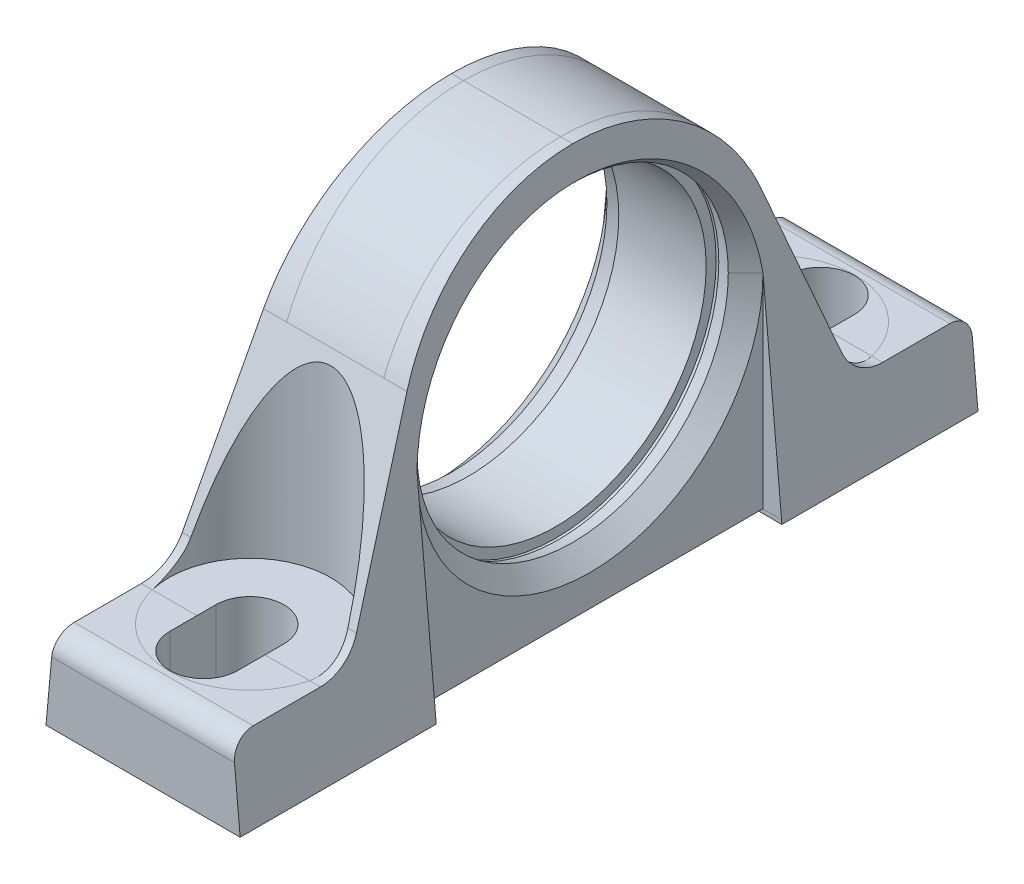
ISO-10303-21;
HEADER;
FILE_DESCRIPTION(('STEP AP214'),'2;1');
FILE_NAME('part.step','',(''),(''),'','','');
FILE_SCHEMA(('AUTOMOTIVE_DESIGN { 1 0 10303 214 1 1 1 1 }'));
ENDSEC;
DATA;
#1=APPLICATION_CONTEXT('core data for automotive mechanical design processes');
#2=APPLICATION_PROTOCOL_DEFINITION('international standard','automotive_design',2000,#1);
#3=PRODUCT_CONTEXT('',#1,'mechanical');
#4=PRODUCT('Part','Part','',(#3));
#5=PRODUCT_RELATED_PRODUCT_CATEGORY('part','',(#4));
#6=PRODUCT_DEFINITION_FORMATION('','',#4);
#7=PRODUCT_DEFINITION_CONTEXT('part definition',#1,'design');
#8=PRODUCT_DEFINITION('design','',#6,#7);
#9=PRODUCT_DEFINITION_SHAPE('','',#8);
#10=(LENGTH_UNIT() NAMED_UNIT(*) SI_UNIT(.MILLI.,.METRE.));
#11=(NAMED_UNIT(*) PLANE_ANGLE_UNIT() SI_UNIT($,.RADIAN.));
#12=(NAMED_UNIT(*) SI_UNIT($,.STERADIAN.) SOLID_ANGLE_UNIT());
#13=UNCERTAINTY_MEASURE_WITH_UNIT(LENGTH_MEASURE(1.E-05),#10,'distance_accuracy_value','');
#14=(GEOMETRIC_REPRESENTATION_CONTEXT(3) GLOBAL_UNCERTAINTY_ASSIGNED_CONTEXT((#13)) GLOBAL_UNIT_ASSIGNED_CONTEXT((#10,
#11,#12)) REPRESENTATION_CONTEXT('',''));
#15=CARTESIAN_POINT('',(0.,0.,0.));
#16=DIRECTION('',(0.,0.,1.));
#17=DIRECTION('',(1.,0.,0.));
#18=AXIS2_PLACEMENT_3D('',#15,#16,#17);
#19=CARTESIAN_POINT('',(-20.,-25.9,-15.00868142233));
#20=DIRECTION('',(0.,-1.,0.));
#21=DIRECTION('',(1.,0.,0.));
#22=AXIS2_PLACEMENT_3D('',#19,#20,#21);
#23=PLANE('',#22);
#24=CARTESIAN_POINT('',(0.,-25.9,-11.1));
#25=DIRECTION('',(0.,-1.,0.));
#26=DIRECTION('',(0.,0.,-1.));
#27=AXIS2_PLACEMENT_3D('',#24,#25,#26);
#28=CIRCLE('',#27,16.668);
#29=CARTESIAN_POINT('',(-16.2032229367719,-25.9,-15.00868142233));
#30=VERTEX_POINT('',#29);
#31=CARTESIAN_POINT('',(16.203222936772,-25.9,-15.00868142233));
#32=VERTEX_POINT('',#31);
#33=EDGE_CURVE('E11',#30,#32,#28,.T.);
#34=ORIENTED_EDGE('',*,*,#33,.F.);
#35=DIRECTION('',(1.,0.,0.));
#36=VECTOR('',#35,1.);
#37=CARTESIAN_POINT('',(-20.,-25.9,-15.00868142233));
#38=LINE('',#37,#36);
#39=CARTESIAN_POINT('',(-7.,-25.9,-15.00868142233));
#40=VERTEX_POINT('',#39);
#41=EDGE_CURVE('E355',#30,#40,#38,.T.);
#42=ORIENTED_EDGE('',*,*,#41,.T.);
#43=DIRECTION('',(0.,0.,1.));
#44=VECTOR('',#43,1.);
#45=CARTESIAN_POINT('',(-7.,-25.9,-15.00868142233));
#46=LINE('',#45,#44);
#47=CARTESIAN_POINT('',(-7.,-25.9,-20.6));
#48=VERTEX_POINT('',#47);
#49=EDGE_CURVE('E536',#48,#40,#46,.T.);
#50=ORIENTED_EDGE('',*,*,#49,.F.);
#51=CARTESIAN_POINT('',(0.,-25.9,-20.6));
#52=DIRECTION('',(0.,-1.,0.));
#53=DIRECTION('',(0.,0.,-1.));
#54=AXIS2_PLACEMENT_3D('',#51,#52,#53);
#55=CIRCLE('',#54,7.);
#56=CARTESIAN_POINT('',(7.,-25.9,-20.6));
#57=VERTEX_POINT('',#56);
#58=EDGE_CURVE('E546',#57,#48,#55,.F.);
#59=ORIENTED_EDGE('',*,*,#58,.F.);
#60=DIRECTION('',(0.,0.,-1.));
#61=VECTOR('',#60,1.);
#62=CARTESIAN_POINT('',(7.,-25.9,-15.00868142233));
#63=LINE('',#62,#61);
#64=CARTESIAN_POINT('',(7.,-25.9,-15.00868142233));
#65=VERTEX_POINT('',#64);
#66=EDGE_CURVE('E376',#65,#57,#63,.T.);
#67=ORIENTED_EDGE('',*,*,#66,.F.);
#68=DIRECTION('',(1.,0.,0.));
#69=VECTOR('',#68,1.);
#70=CARTESIAN_POINT('',(-20.,-25.9,-15.00868142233));
#71=LINE('',#70,#69);
#72=EDGE_CURVE('E352',#65,#32,#71,.T.);
#73=ORIENTED_EDGE('',*,*,#72,.T.);
#74=EDGE_LOOP('',(#34,#42,#50,#59,#67,#73));
#75=FACE_BOUND('',#74,.T.);
#76=ADVANCED_FACE('F32',(#75),#23,.F.);
#77=CARTESIAN_POINT('',(20.,-25.9,100.80868142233));
#78=DIRECTION('',(0.,-1.,0.));
#79=DIRECTION('',(-1.,0.,0.));
#80=AXIS2_PLACEMENT_3D('',#77,#78,#79);
#81=PLANE('',#80);
#82=CARTESIAN_POINT('',(0.,-25.9,96.9));
#83=DIRECTION('',(0.,-1.,0.));
#84=DIRECTION('',(0.,0.,-1.));
#85=AXIS2_PLACEMENT_3D('',#82,#83,#84);
#86=CIRCLE('',#85,16.668);
#87=CARTESIAN_POINT('',(16.203222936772,-25.9,100.80868142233));
#88=VERTEX_POINT('',#87);
#89=CARTESIAN_POINT('',(-16.203222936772,-25.9,100.80868142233));
#90=VERTEX_POINT('',#89);
#91=EDGE_CURVE('E529',#88,#90,#86,.T.);
#92=ORIENTED_EDGE('',*,*,#91,.F.);
#93=DIRECTION('',(-1.,0.,0.));
#94=VECTOR('',#93,1.);
#95=CARTESIAN_POINT('',(20.,-25.9,100.80868142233));
#96=LINE('',#95,#94);
#97=CARTESIAN_POINT('',(7.,-25.9,100.80868142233));
#98=VERTEX_POINT('',#97);
#99=EDGE_CURVE('E967',#88,#98,#96,.T.);
#100=ORIENTED_EDGE('',*,*,#99,.T.);
#101=DIRECTION('',(0.,0.,-1.));
#102=VECTOR('',#101,1.);
#103=CARTESIAN_POINT('',(7.,-25.9,100.80868142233));
#104=LINE('',#103,#102);
#105=CARTESIAN_POINT('',(7.,-25.9,106.4));
#106=VERTEX_POINT('',#105);
#107=EDGE_CURVE('E574',#106,#98,#104,.T.);
#108=ORIENTED_EDGE('',*,*,#107,.F.);
#109=CARTESIAN_POINT('',(0.,-25.9,106.4));
#110=DIRECTION('',(0.,-1.,0.));
#111=DIRECTION('',(0.,0.,-1.));
#112=AXIS2_PLACEMENT_3D('',#109,#110,#111);
#113=CIRCLE('',#112,7.);
#114=CARTESIAN_POINT('',(-7.,-25.9,106.4));
#115=VERTEX_POINT('',#114);
#116=EDGE_CURVE('E579',#115,#106,#113,.F.);
#117=ORIENTED_EDGE('',*,*,#116,.F.);
#118=DIRECTION('',(0.,0.,1.));
#119=VECTOR('',#118,1.);
#120=CARTESIAN_POINT('',(-7.,-25.9,100.80868142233));
#121=LINE('',#120,#119);
#122=CARTESIAN_POINT('',(-7.,-25.9,100.80868142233));
#123=VERTEX_POINT('',#122);
#124=EDGE_CURVE('E577',#123,#115,#121,.T.);
#125=ORIENTED_EDGE('',*,*,#124,.F.);
#126=DIRECTION('',(-1.,0.,0.));
#127=VECTOR('',#126,1.);
#128=CARTESIAN_POINT('',(20.,-25.9,100.80868142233));
#129=LINE('',#128,#127);
#130=EDGE_CURVE('E420',#123,#90,#129,.T.);
#131=ORIENTED_EDGE('',*,*,#130,.T.);
#132=EDGE_LOOP('',(#92,#100,#108,#117,#125,#131));
#133=FACE_BOUND('',#132,.T.);
#134=ADVANCED_FACE('F840',(#133),#81,.F.);
#135=CARTESIAN_POINT('',(-20.,14.2348270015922,6.4832497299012));
#136=DIRECTION('',(0.,-0.364062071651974,0.931374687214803));
#137=DIRECTION('',(0.,0.931374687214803,0.364062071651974));
#138=AXIS2_PLACEMENT_3D('',#135,#136,#137);
#139=PLANE('',#138);
#140=DIRECTION('',(1.,0.,0.));
#141=VECTOR('',#140,1.);
#142=CARTESIAN_POINT('',(-20.,-20.4945276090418,-7.09199658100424));
#143=LINE('',#142,#141);
#144=CARTESIAN_POINT('',(16.1789410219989,-20.4945276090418,-7.09199658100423));
#145=VERTEX_POINT('',#144);
#146=CARTESIAN_POINT('',(17.9507189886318,-20.4945276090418,-7.09199658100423));
#147=VERTEX_POINT('',#146);
#148=EDGE_CURVE('E377',#145,#147,#143,.T.);
#149=ORIENTED_EDGE('',*,*,#148,.F.);
#150=CARTESIAN_POINT('',(0.,-30.7481442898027,-11.1));
#151=DIRECTION('',(0.,-0.364062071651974,0.931374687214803));
#152=DIRECTION('',(0.,-0.931374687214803,-0.364062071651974));
#153=AXIS2_PLACEMENT_3D('',#150,#151,#152);
#154=ELLIPSE('',#153,45.7834015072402,16.668);
#155=CARTESIAN_POINT('',(-16.1789410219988,-20.4945276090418,-7.09199658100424));
#156=VERTEX_POINT('',#155);
#157=EDGE_CURVE('E344',#145,#156,#154,.T.);
#158=ORIENTED_EDGE('',*,*,#157,.T.);
#159=CARTESIAN_POINT('',(-17.9507189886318,-20.4945276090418,-7.09199658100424));
#160=VERTEX_POINT('',#159);
#161=EDGE_CURVE('E380',#160,#156,#143,.T.);
#162=ORIENTED_EDGE('',*,*,#161,.F.);
#163=DIRECTION('',(-0.0848792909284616,-0.928013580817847,-0.362748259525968));
#164=VECTOR('',#163,1.);
#165=CARTESIAN_POINT('',(-14.8119024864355,13.8231994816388,6.32234996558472));
#166=LINE('',#165,#164);
#167=CARTESIAN_POINT('',(-14.7742536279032,14.2348270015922,6.4832497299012));
#168=VERTEX_POINT('',#167);
#169=EDGE_CURVE('E654',#168,#160,#166,.T.);
#170=ORIENTED_EDGE('',*,*,#169,.F.);
#171=DIRECTION('',(1.,0.,0.));
#172=VECTOR('',#171,1.);
#173=CARTESIAN_POINT('',(-20.,14.2348270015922,6.4832497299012));
#174=LINE('',#173,#172);
#175=CARTESIAN_POINT('',(-10.,14.2348270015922,6.4832497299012));
#176=VERTEX_POINT('',#175);
#177=EDGE_CURVE('E400',#168,#176,#174,.T.);
#178=ORIENTED_EDGE('',*,*,#177,.T.);
#179=CARTESIAN_POINT('',(10.,14.2348270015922,6.4832497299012));
#180=VERTEX_POINT('',#179);
#181=EDGE_CURVE('E403',#176,#180,#174,.T.);
#182=ORIENTED_EDGE('',*,*,#181,.T.);
#183=CARTESIAN_POINT('',(14.7742536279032,14.2348270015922,6.4832497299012));
#184=VERTEX_POINT('',#183);
#185=EDGE_CURVE('E404',#180,#184,#174,.T.);
#186=ORIENTED_EDGE('',*,*,#185,.T.);
#187=DIRECTION('',(0.0848792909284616,-0.928013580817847,-0.362748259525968));
#188=VECTOR('',#187,1.);
#189=CARTESIAN_POINT('',(14.5237227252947,16.9739648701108,7.55394256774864));
#190=LINE('',#189,#188);
#191=EDGE_CURVE('E616',#184,#147,#190,.T.);
#192=ORIENTED_EDGE('',*,*,#191,.T.);
#193=EDGE_LOOP('',(#149,#158,#162,#170,#178,#182,#186,#192));
#194=FACE_BOUND('',#193,.T.);
#195=ADVANCED_FACE('F701',(#194),#139,.F.);
#196=CARTESIAN_POINT('',(-20.,-17.4,-15.00868142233));
#197=DIRECTION('',(1.,0.,0.));
#198=DIRECTION('',(0.,0.,-1.));
#199=AXIS2_PLACEMENT_3D('',#196,#197,#198);
#200=CYLINDRICAL_SURFACE('',#199,8.5);
#201=CARTESIAN_POINT('',(11.1286499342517,-17.4,-23.50868142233));
#202=CARTESIAN_POINT('',(11.1286530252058,-17.2053244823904,-23.5086796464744));
#203=CARTESIAN_POINT('',(11.1361405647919,-17.010624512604,-23.5019759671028));
#204=CARTESIAN_POINT('',(11.1657275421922,-16.6232446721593,-23.4753438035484));
#205=CARTESIAN_POINT('',(11.1878298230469,-16.4305652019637,-23.4554127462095));
#206=CARTESIAN_POINT('',(11.2456493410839,-16.0487742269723,-23.4028091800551));
#207=CARTESIAN_POINT('',(11.2813857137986,-15.8596681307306,-23.3701187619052));
#208=CARTESIAN_POINT('',(11.3649957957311,-15.486601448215,-23.2927163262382));
#209=CARTESIAN_POINT('',(11.4128762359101,-15.3026437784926,-23.2479976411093));
#210=CARTESIAN_POINT('',(11.5183797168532,-14.943208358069,-23.1480019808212));
#211=CARTESIAN_POINT('',(11.5758726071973,-14.7676530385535,-23.0928649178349));
#212=CARTESIAN_POINT('',(11.6993192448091,-14.4232021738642,-22.972472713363));
#213=CARTESIAN_POINT('',(11.7652720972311,-14.254305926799,-22.9072186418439));
#214=CARTESIAN_POINT('',(11.9735060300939,-13.7578642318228,-22.6972430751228));
#215=CARTESIAN_POINT('',(12.1261698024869,-13.4405422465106,-22.5383015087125));
#216=CARTESIAN_POINT('',(12.4089925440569,-12.9082031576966,-22.2297719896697));
#217=CARTESIAN_POINT('',(12.5356271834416,-12.6870418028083,-22.087268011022));
#218=CARTESIAN_POINT('',(12.7948632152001,-12.2609487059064,-21.7842605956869));
#219=CARTESIAN_POINT('',(12.9274669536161,-12.056023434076,-21.6237500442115));
#220=CARTESIAN_POINT('',(13.195662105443,-11.6624379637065,-21.2854513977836));
#221=CARTESIAN_POINT('',(13.3312578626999,-11.4738036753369,-21.1076367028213));
#222=CARTESIAN_POINT('',(13.6025640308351,-11.1135850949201,-20.7356352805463));
#223=CARTESIAN_POINT('',(13.7382744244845,-10.9419985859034,-20.5414506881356));
#224=CARTESIAN_POINT('',(14.008956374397,-10.6147631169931,-20.135023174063));
#225=CARTESIAN_POINT('',(14.1439028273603,-10.4593131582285,-19.9226030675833));
#226=CARTESIAN_POINT('',(14.409254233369,-10.1676317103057,-19.4822252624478));
#227=CARTESIAN_POINT('',(14.5396587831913,-10.0314019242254,-19.2542661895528));
#228=CARTESIAN_POINT('',(14.7935471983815,-9.77978630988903,-18.7840393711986));
#229=CARTESIAN_POINT('',(14.9170422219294,-9.66436616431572,-18.5417960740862));
#230=CARTESIAN_POINT('',(15.1552578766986,-9.45576838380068,-18.0438100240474));
#231=CARTESIAN_POINT('',(15.2699809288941,-9.3625845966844,-17.7880710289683));
#232=CARTESIAN_POINT('',(15.4656384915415,-9.21737670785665,-17.3198391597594));
#233=CARTESIAN_POINT('',(15.5485987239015,-9.16081704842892,-17.1095897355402));
#234=CARTESIAN_POINT('',(15.706934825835,-9.06359418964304,-16.6826714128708));
#235=CARTESIAN_POINT('',(15.7823121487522,-9.02292793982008,-16.4660037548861));
#236=CARTESIAN_POINT('',(15.9246534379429,-8.95837760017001,-16.0275490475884));
#237=CARTESIAN_POINT('',(15.991620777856,-8.93448676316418,-15.8057640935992));
#238=CARTESIAN_POINT('',(16.1165032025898,-8.90424221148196,-15.3584575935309));
#239=CARTESIAN_POINT('',(16.1744180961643,-8.89788886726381,-15.1329359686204));
#240=CARTESIAN_POINT('',(16.2809241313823,-8.90335385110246,-14.6788744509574));
#241=CARTESIAN_POINT('',(16.3294738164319,-8.91525097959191,-14.450325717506));
#242=CARTESIAN_POINT('',(16.416654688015,-8.95776993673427,-13.9930679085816));
#243=CARTESIAN_POINT('',(16.4552858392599,-8.98839183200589,-13.764358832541));
#244=CARTESIAN_POINT('',(16.5226032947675,-9.06849939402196,-13.3088048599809));
#245=CARTESIAN_POINT('',(16.5512903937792,-9.11798355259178,-13.0819598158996));
#246=CARTESIAN_POINT('',(16.5989723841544,-9.23567884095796,-12.6321508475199));
#247=CARTESIAN_POINT('',(16.6179677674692,-9.30388901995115,-12.4091867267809));
#248=CARTESIAN_POINT('',(16.6457335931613,-9.45296900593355,-11.9851979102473));
#249=CARTESIAN_POINT('',(16.6551496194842,-9.53254998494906,-11.7837603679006));
#250=CARTESIAN_POINT('',(16.6667038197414,-9.70697793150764,-11.3873108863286));
#251=CARTESIAN_POINT('',(16.668839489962,-9.80183013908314,-11.1923011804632));
#252=CARTESIAN_POINT('',(16.6665754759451,-10.0061046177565,-10.8102017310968));
#253=CARTESIAN_POINT('',(16.6621779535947,-10.1155220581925,-10.6231093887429));
#254=CARTESIAN_POINT('',(16.6477185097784,-10.348253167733,-10.2579161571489));
#255=CARTESIAN_POINT('',(16.6376543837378,-10.4715722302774,-10.0798187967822));
#256=CARTESIAN_POINT('',(16.6125019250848,-10.7345677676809,-9.72936102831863));
#257=CARTESIAN_POINT('',(16.597292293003,-10.8745805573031,-9.55726182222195));
#258=CARTESIAN_POINT('',(16.5630113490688,-11.1674731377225,-9.22467463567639));
#259=CARTESIAN_POINT('',(16.5439383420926,-11.3203585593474,-9.06419179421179));
#260=CARTESIAN_POINT('',(16.5030651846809,-11.6380119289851,-8.75580205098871));
#261=CARTESIAN_POINT('',(16.4812647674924,-11.802781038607,-8.60789638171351));
#262=CARTESIAN_POINT('',(16.4360794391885,-12.1432223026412,-8.3254779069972));
#263=CARTESIAN_POINT('',(16.4126944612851,-12.318894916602,-8.19096566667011));
#264=CARTESIAN_POINT('',(16.3638522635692,-12.6925126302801,-7.92734376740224));
#265=CARTESIAN_POINT('',(16.3383627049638,-12.8911592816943,-7.79923285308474));
#266=CARTESIAN_POINT('',(16.2882021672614,-13.2984351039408,-7.55999521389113));
#267=CARTESIAN_POINT('',(16.2635309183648,-13.5070609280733,-7.44886284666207));
#268=CARTESIAN_POINT('',(16.216236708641,-13.9331238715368,-7.2442342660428));
#269=CARTESIAN_POINT('',(16.1936145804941,-14.150564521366,-7.15074520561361));
#270=CARTESIAN_POINT('',(16.1515716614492,-14.5926714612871,-6.98217211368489));
#271=CARTESIAN_POINT('',(16.1321495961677,-14.8173348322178,-6.90708074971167));
#272=CARTESIAN_POINT('',(16.0972742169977,-15.2750077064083,-6.77510630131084));
#273=CARTESIAN_POINT('',(16.0818679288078,-15.5080826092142,-6.71843719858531));
#274=CARTESIAN_POINT('',(16.0561086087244,-15.9784645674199,-6.62496299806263));
#275=CARTESIAN_POINT('',(16.0457556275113,-16.2157716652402,-6.58815809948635));
#276=CARTESIAN_POINT('',(16.0306440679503,-16.6927685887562,-6.5347565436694));
#277=CARTESIAN_POINT('',(16.0258840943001,-16.9324578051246,-6.51815484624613));
#278=CARTESIAN_POINT('',(16.0222038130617,-17.4124219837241,-6.50530127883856));
#279=CARTESIAN_POINT('',(16.0232833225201,-17.6526969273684,-6.50904877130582));
#280=CARTESIAN_POINT('',(16.0310789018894,-18.1232361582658,-6.53634805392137));
#281=CARTESIAN_POINT('',(16.0375883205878,-18.3535464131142,-6.55917382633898));
#282=CARTESIAN_POINT('',(16.0556574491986,-18.8113392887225,-6.62348332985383));
#283=CARTESIAN_POINT('',(16.0672170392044,-19.0388219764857,-6.66496661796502));
#284=CARTESIAN_POINT('',(16.0948285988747,-19.4893761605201,-6.76624119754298));
#285=CARTESIAN_POINT('',(16.1108802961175,-19.7124479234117,-6.82603137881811));
#286=CARTESIAN_POINT('',(16.1467160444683,-20.1527993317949,-6.9634767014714));
#287=CARTESIAN_POINT('',(16.166501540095,-20.370076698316,-7.04113875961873));
#288=CARTESIAN_POINT('',(16.2090307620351,-20.7990844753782,-7.21444152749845));
#289=CARTESIAN_POINT('',(16.231796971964,-21.0107563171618,-7.31022162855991));
#290=CARTESIAN_POINT('',(16.2790720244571,-21.4254921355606,-7.51873413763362));
#291=CARTESIAN_POINT('',(16.303581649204,-21.6285521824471,-7.63147418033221));
#292=CARTESIAN_POINT('',(16.3531320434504,-22.0247328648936,-7.87315825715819));
#293=CARTESIAN_POINT('',(16.3781728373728,-22.2178530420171,-8.00210303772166));
#294=CARTESIAN_POINT('',(16.4275125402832,-22.5929615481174,-8.27540568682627));
#295=CARTESIAN_POINT('',(16.4518114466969,-22.7749498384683,-8.41976360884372));
#296=CARTESIAN_POINT('',(16.4991610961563,-23.1327282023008,-8.72827320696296));
#297=CARTESIAN_POINT('',(16.5221398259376,-23.3080876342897,-8.89293604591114));
#298=CARTESIAN_POINT('',(16.5644301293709,-23.6443680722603,-9.2367095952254));
#299=CARTESIAN_POINT('',(16.5837431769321,-23.8052948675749,-9.41581445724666));
#300=CARTESIAN_POINT('',(16.6172768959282,-24.11158783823,-9.78732682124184));
#301=CARTESIAN_POINT('',(16.6314975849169,-24.2569540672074,-9.9797342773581));
#302=CARTESIAN_POINT('',(16.6534732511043,-24.5309642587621,-10.3764619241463));
#303=CARTESIAN_POINT('',(16.6612285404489,-24.659609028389,-10.5807815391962));
#304=CARTESIAN_POINT('',(16.6688909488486,-24.8952881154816,-10.993058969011));
#305=CARTESIAN_POINT('',(16.669040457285,-25.002880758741,-11.2006929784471));
#306=CARTESIAN_POINT('',(16.6611059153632,-25.2005432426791,-11.6239979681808));
#307=CARTESIAN_POINT('',(16.653022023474,-25.2906134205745,-11.839668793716));
#308=CARTESIAN_POINT('',(16.6278251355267,-25.4525141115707,-12.2771275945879));
#309=CARTESIAN_POINT('',(16.6107164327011,-25.5243532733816,-12.4989126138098));
#310=CARTESIAN_POINT('',(16.5669056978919,-25.649390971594,-12.9467438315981));
#311=CARTESIAN_POINT('',(16.5402041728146,-25.7025904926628,-13.1727898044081));
#312=CARTESIAN_POINT('',(16.4790239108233,-25.7872354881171,-13.6119354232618));
#313=CARTESIAN_POINT('',(16.4451839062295,-25.8198968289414,-13.8248911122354));
#314=CARTESIAN_POINT('',(16.3688590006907,-25.8688907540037,-14.2511180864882));
#315=CARTESIAN_POINT('',(16.3263745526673,-25.8852241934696,-14.4643893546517));
#316=CARTESIAN_POINT('',(16.2329244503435,-25.9018315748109,-14.8896965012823));
#317=CARTESIAN_POINT('',(16.1819583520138,-25.9021046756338,-15.1017323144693));
#318=CARTESIAN_POINT('',(16.0718917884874,-25.8870378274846,-15.5231146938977));
#319=CARTESIAN_POINT('',(16.0127910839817,-25.8716974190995,-15.7324611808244));
#320=CARTESIAN_POINT('',(15.8862592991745,-25.8257417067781,-16.1494542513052));
#321=CARTESIAN_POINT('',(15.8187435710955,-25.7949598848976,-16.3570566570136));
#322=CARTESIAN_POINT('',(15.6765179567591,-25.7187403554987,-16.7671090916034));
#323=CARTESIAN_POINT('',(15.6018054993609,-25.6732973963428,-16.9695572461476));
#324=CARTESIAN_POINT('',(15.4459502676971,-25.5685387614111,-17.3682249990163));
#325=CARTESIAN_POINT('',(15.3648089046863,-25.5092261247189,-17.5644459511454));
#326=CARTESIAN_POINT('',(15.1968421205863,-25.3774799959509,-17.9499966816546));
#327=CARTESIAN_POINT('',(15.1100146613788,-25.3050417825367,-18.1393239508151));
#328=CARTESIAN_POINT('',(14.9208274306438,-25.1383829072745,-18.5326498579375));
#329=CARTESIAN_POINT('',(14.8178531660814,-25.0425922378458,-18.7356881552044));
#330=CARTESIAN_POINT('',(14.6070086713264,-24.8364471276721,-19.1316792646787));
#331=CARTESIAN_POINT('',(14.4991363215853,-24.726086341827,-19.3246276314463));
#332=CARTESIAN_POINT('',(14.2796593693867,-24.4915507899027,-19.7000511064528));
#333=CARTESIAN_POINT('',(14.1680508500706,-24.3673611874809,-19.8825146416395));
#334=CARTESIAN_POINT('',(13.9425484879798,-24.1060119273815,-20.2362771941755));
#335=CARTESIAN_POINT('',(13.8286553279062,-23.9688561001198,-20.4075794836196));
#336=CARTESIAN_POINT('',(13.5810070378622,-23.6583796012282,-20.7660971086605));
#337=CARTESIAN_POINT('',(13.4470788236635,-23.4828275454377,-20.9512666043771));
#338=CARTESIAN_POINT('',(13.1802550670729,-23.11534752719,-21.3055024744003));
#339=CARTESIAN_POINT('',(13.0473597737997,-22.9234157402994,-21.4745650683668));
#340=CARTESIAN_POINT('',(12.7853794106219,-22.5236056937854,-21.7957572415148));
#341=CARTESIAN_POINT('',(12.6562927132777,-22.315734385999,-21.9478941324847));
#342=CARTESIAN_POINT('',(12.4050720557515,-21.8841344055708,-22.2343007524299));
#343=CARTESIAN_POINT('',(12.282935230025,-21.6604123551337,-22.3685778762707));
#344=CARTESIAN_POINT('',(12.0844518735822,-21.2666534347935,-22.580530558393));
#345=CARTESIAN_POINT('',(12.0053540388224,-21.1006268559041,-22.663107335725));
#346=CARTESIAN_POINT('',(11.8539622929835,-20.7608645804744,-22.818256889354));
#347=CARTESIAN_POINT('',(11.7816701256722,-20.5871269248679,-22.8908271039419));
#348=CARTESIAN_POINT('',(11.6457729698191,-20.2325564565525,-23.0250706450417));
#349=CARTESIAN_POINT('',(11.5821533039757,-20.0517363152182,-23.0867624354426));
#350=CARTESIAN_POINT('',(11.4653686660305,-19.6833350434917,-23.1985157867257));
#351=CARTESIAN_POINT('',(11.4121968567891,-19.4957584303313,-23.248584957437));
#352=CARTESIAN_POINT('',(11.3273557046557,-19.1519095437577,-23.3276699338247));
#353=CARTESIAN_POINT('',(11.293515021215,-18.9966776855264,-23.3588877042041));
#354=CARTESIAN_POINT('',(11.2347355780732,-18.6831297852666,-23.412779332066));
#355=CARTESIAN_POINT('',(11.2097926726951,-18.5248152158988,-23.4354571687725));
#356=CARTESIAN_POINT('',(11.1695555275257,-18.2059810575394,-23.471903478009));
#357=CARTESIAN_POINT('',(11.1542585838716,-18.0454620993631,-23.4856744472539));
#358=CARTESIAN_POINT('',(11.1338058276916,-17.7233008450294,-23.5040629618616));
#359=CARTESIAN_POINT('',(11.1286473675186,-17.5616588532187,-23.5086828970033));
#360=CARTESIAN_POINT('',(11.1286499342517,-17.4,-23.50868142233));
#361=B_SPLINE_CURVE_WITH_KNOTS('',3,(#201,#202,#203,#204,#205,#206,#207,#208,#209,#210,#211,
#212,#213,#214,#215,#216,#217,#218,#219,#220,#221,#222,#223,#224,#225,#226,#227,#228,#229,#230,
#231,#232,#233,#234,#235,#236,#237,#238,#239,#240,#241,#242,#243,#244,#245,#246,#247,#248,#249,
#250,#251,#252,#253,#254,#255,#256,#257,#258,#259,#260,#261,#262,#263,#264,#265,#266,#267,#268,
#269,#270,#271,#272,#273,#274,#275,#276,#277,#278,#279,#280,#281,#282,#283,#284,#285,#286,#287,
#288,#289,#290,#291,#292,#293,#294,#295,#296,#297,#298,#299,#300,#301,#302,#303,#304,#305,#306,
#307,#308,#309,#310,#311,#312,#313,#314,#315,#316,#317,#318,#319,#320,#321,#322,#323,#324,#325,
#326,#327,#328,#329,#330,#331,#332,#333,#334,#335,#336,#337,#338,#339,#340,#341,#342,#343,#344,
#345,#346,#347,#348,#349,#350,#351,#352,#353,#354,#355,#356,#357,#358,#359,#360),.UNSPECIFIED.,
.T.,.F.,(4,2,2,2,2,2,2,2,2,2,2,2,2,2,2,2,2,2,2,2,2,2,2,2,2,2,2,2,2,2,2,2,2,2,2,2,2,2,2,2,2,2,2,
2,2,2,2,2,2,2,2,2,2,2,2,2,2,2,2,2,2,2,2,2,2,2,2,2,2,2,2,2,2,2,2,2,2,2,2,4),(0.,
0.583815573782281,1.16774475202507,1.75249651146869,2.33757308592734,2.91528880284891,
3.49294346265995,4.64817672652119,5.52317268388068,6.39851559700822,7.27522601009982,
8.15182226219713,9.03819102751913,9.92463828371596,10.8096100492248,11.6943366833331,
12.3926239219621,13.0907770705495,13.7886492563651,14.4865361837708,15.1874448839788,
15.8883560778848,16.5892112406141,17.2900308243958,17.9396539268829,18.5895004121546,
19.2391319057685,19.8890163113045,20.5554333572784,21.2221434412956,21.8889187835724,
22.5557222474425,23.2681318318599,23.9803041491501,24.6927645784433,25.4049405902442,
26.1251155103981,26.8452976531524,27.565300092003,28.2852799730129,28.9790462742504,
29.6727961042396,30.366503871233,31.0604805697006,31.7600311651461,32.4598976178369,
33.1597963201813,33.8596974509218,34.5837523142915,35.3075154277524,36.0312760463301,
36.755001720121,37.4556479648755,38.1562807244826,38.8565804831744,39.5568432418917,
40.2103243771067,40.8637712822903,41.5172524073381,42.1707527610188,42.8314569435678,
43.4923980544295,44.1531944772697,44.8142290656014,45.554471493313,46.2950373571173,
47.0364055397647,47.7775553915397,48.6411369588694,49.5049207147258,50.368329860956,
51.2313803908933,51.8357209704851,52.4402159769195,53.0436748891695,53.6467375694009,
54.1320280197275,54.6170920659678,55.1020200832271,55.5868214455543),.UNSPECIFIED.);
#362=EDGE_CURVE('E338',#145,#32,#361,.T.);
#363=ORIENTED_EDGE('',*,*,#362,.F.);
#364=ORIENTED_EDGE('',*,*,#148,.T.);
#365=CARTESIAN_POINT('',(17.6676829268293,-17.4,-15.00868142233));
#366=DIRECTION('',(-0.995843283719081,-0.0910832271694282,0.));
#367=DIRECTION('',(0.0910832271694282,-0.995843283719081,0.));
#368=AXIS2_PLACEMENT_3D('',#365,#366,#367);
#369=ELLIPSE('',#368,8.53547956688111,8.5);
#370=CARTESIAN_POINT('',(18.4451219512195,-25.9,-15.00868142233));
#371=VERTEX_POINT('',#370);
#372=EDGE_CURVE('E370',#371,#147,#369,.T.);
#373=ORIENTED_EDGE('',*,*,#372,.F.);
#374=EDGE_CURVE('E362',#32,#371,#71,.T.);
#375=ORIENTED_EDGE('',*,*,#374,.F.);
#376=EDGE_LOOP('',(#363,#364,#373,#375));
#377=FACE_BOUND('',#376,.T.);
#378=ADVANCED_FACE('F368',(#377),#200,.F.);
#379=CARTESIAN_POINT('',(-11.1286499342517,-17.4,-23.50868142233));
#380=CARTESIAN_POINT('',(-11.1286530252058,-17.5946755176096,-23.5086796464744));
#381=CARTESIAN_POINT('',(-11.1361405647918,-17.7893754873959,-23.5019759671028));
#382=CARTESIAN_POINT('',(-11.1657275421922,-18.1767553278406,-23.4753438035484));
#383=CARTESIAN_POINT('',(-11.1878298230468,-18.3694347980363,-23.4554127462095));
#384=CARTESIAN_POINT('',(-11.2456493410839,-18.7512257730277,-23.4028091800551));
#385=CARTESIAN_POINT('',(-11.2813857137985,-18.9403318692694,-23.3701187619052));
#386=CARTESIAN_POINT('',(-11.3649957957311,-19.313398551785,-23.2927163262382));
#387=CARTESIAN_POINT('',(-11.4128762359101,-19.4973562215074,-23.2479976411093));
#388=CARTESIAN_POINT('',(-11.5183797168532,-19.856791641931,-23.1480019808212));
#389=CARTESIAN_POINT('',(-11.5758726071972,-20.0323469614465,-23.0928649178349));
#390=CARTESIAN_POINT('',(-11.6993192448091,-20.3767978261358,-22.972472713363));
#391=CARTESIAN_POINT('',(-11.7652720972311,-20.545694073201,-22.9072186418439));
#392=CARTESIAN_POINT('',(-11.9735060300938,-21.0421357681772,-22.6972430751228));
#393=CARTESIAN_POINT('',(-12.1261698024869,-21.3594577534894,-22.5383015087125));
#394=CARTESIAN_POINT('',(-12.4089925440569,-21.8917968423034,-22.2297719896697));
#395=CARTESIAN_POINT('',(-12.5356271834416,-22.1129581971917,-22.087268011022));
#396=CARTESIAN_POINT('',(-12.7948632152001,-22.5390512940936,-21.7842605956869));
#397=CARTESIAN_POINT('',(-12.9274669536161,-22.743976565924,-21.6237500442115));
#398=CARTESIAN_POINT('',(-13.195662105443,-23.1375620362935,-21.2854513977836));
#399=CARTESIAN_POINT('',(-13.3312578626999,-23.3261963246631,-21.1076367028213));
#400=CARTESIAN_POINT('',(-13.6025640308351,-23.6864149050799,-20.7356352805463));
#401=CARTESIAN_POINT('',(-13.7382744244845,-23.8580014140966,-20.5414506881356));
#402=CARTESIAN_POINT('',(-14.0089563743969,-24.1852368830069,-20.135023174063));
#403=CARTESIAN_POINT('',(-14.1439028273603,-24.3406868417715,-19.9226030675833));
#404=CARTESIAN_POINT('',(-14.409254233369,-24.6323682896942,-19.4822252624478));
#405=CARTESIAN_POINT('',(-14.5396587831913,-24.7685980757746,-19.2542661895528));
#406=CARTESIAN_POINT('',(-14.7935471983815,-25.020213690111,-18.7840393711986));
#407=CARTESIAN_POINT('',(-14.9170422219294,-25.1356338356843,-18.5417960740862));
#408=CARTESIAN_POINT('',(-15.1552578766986,-25.3442316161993,-18.0438100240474));
#409=CARTESIAN_POINT('',(-15.2699809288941,-25.4374154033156,-17.7880710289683));
#410=CARTESIAN_POINT('',(-15.4656384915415,-25.5826232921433,-17.3198391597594));
#411=CARTESIAN_POINT('',(-15.5485987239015,-25.6391829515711,-17.1095897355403));
#412=CARTESIAN_POINT('',(-15.706934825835,-25.736405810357,-16.6826714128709));
#413=CARTESIAN_POINT('',(-15.7823121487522,-25.7770720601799,-16.4660037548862));
#414=CARTESIAN_POINT('',(-15.9246534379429,-25.84162239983,-16.0275490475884));
#415=CARTESIAN_POINT('',(-15.9916207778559,-25.8655132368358,-15.8057640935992));
#416=CARTESIAN_POINT('',(-16.1165032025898,-25.895757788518,-15.3584575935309));
#417=CARTESIAN_POINT('',(-16.1744180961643,-25.9021111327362,-15.1329359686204));
#418=CARTESIAN_POINT('',(-16.2809241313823,-25.8966461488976,-14.6788744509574));
#419=CARTESIAN_POINT('',(-16.3294738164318,-25.8847490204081,-14.450325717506));
#420=CARTESIAN_POINT('',(-16.416654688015,-25.8422300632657,-13.9930679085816));
#421=CARTESIAN_POINT('',(-16.4552858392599,-25.8116081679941,-13.764358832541));
#422=CARTESIAN_POINT('',(-16.5226032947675,-25.731500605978,-13.3088048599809));
#423=CARTESIAN_POINT('',(-16.5512903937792,-25.6820164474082,-13.0819598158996));
#424=CARTESIAN_POINT('',(-16.5989723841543,-25.564321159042,-12.6321508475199));
#425=CARTESIAN_POINT('',(-16.6179677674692,-25.4961109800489,-12.4091867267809));
#426=CARTESIAN_POINT('',(-16.6457335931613,-25.3470309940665,-11.9851979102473));
#427=CARTESIAN_POINT('',(-16.6551496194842,-25.2674500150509,-11.7837603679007));
#428=CARTESIAN_POINT('',(-16.6667038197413,-25.0930220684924,-11.3873108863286));
#429=CARTESIAN_POINT('',(-16.668839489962,-24.9981698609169,-11.1923011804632));
#430=CARTESIAN_POINT('',(-16.6665754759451,-24.7938953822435,-10.8102017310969));
#431=CARTESIAN_POINT('',(-16.6621779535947,-24.6844779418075,-10.6231093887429));
#432=CARTESIAN_POINT('',(-16.6477185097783,-24.451746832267,-10.2579161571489));
#433=CARTESIAN_POINT('',(-16.6376543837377,-24.3284277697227,-10.0798187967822));
#434=CARTESIAN_POINT('',(-16.6125019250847,-24.0654322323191,-9.72936102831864));
#435=CARTESIAN_POINT('',(-16.597292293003,-23.9254194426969,-9.55726182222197));
#436=CARTESIAN_POINT('',(-16.5630113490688,-23.6325268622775,-9.22467463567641));
#437=CARTESIAN_POINT('',(-16.5439383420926,-23.4796414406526,-9.0641917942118));
#438=CARTESIAN_POINT('',(-16.5030651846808,-23.1619880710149,-8.75580205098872));
#439=CARTESIAN_POINT('',(-16.4812647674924,-22.997218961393,-8.60789638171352));
#440=CARTESIAN_POINT('',(-16.4360794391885,-22.6567776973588,-8.32547790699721));
#441=CARTESIAN_POINT('',(-16.4126944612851,-22.4811050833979,-8.19096566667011));
#442=CARTESIAN_POINT('',(-16.3638522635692,-22.1074873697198,-7.92734376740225));
#443=CARTESIAN_POINT('',(-16.3383627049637,-21.9088407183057,-7.79923285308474));
#444=CARTESIAN_POINT('',(-16.2882021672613,-21.5015648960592,-7.55999521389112));
#445=CARTESIAN_POINT('',(-16.2635309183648,-21.2929390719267,-7.44886284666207));
#446=CARTESIAN_POINT('',(-16.216236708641,-20.8668761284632,-7.2442342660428));
#447=CARTESIAN_POINT('',(-16.1936145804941,-20.6494354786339,-7.15074520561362));
#448=CARTESIAN_POINT('',(-16.1515716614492,-20.2073285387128,-6.9821721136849));
#449=CARTESIAN_POINT('',(-16.1321495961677,-19.9826651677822,-6.90708074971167));
#450=CARTESIAN_POINT('',(-16.0972742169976,-19.5249922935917,-6.77510630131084));
#451=CARTESIAN_POINT('',(-16.0818679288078,-19.2919173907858,-6.71843719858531));
#452=CARTESIAN_POINT('',(-16.0561086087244,-18.8215354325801,-6.62496299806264));
#453=CARTESIAN_POINT('',(-16.0457556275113,-18.5842283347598,-6.58815809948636));
#454=CARTESIAN_POINT('',(-16.0306440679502,-18.1072314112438,-6.53475654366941));
#455=CARTESIAN_POINT('',(-16.0258840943,-17.8675421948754,-6.51815484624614));
#456=CARTESIAN_POINT('',(-16.0222038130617,-17.3875780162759,-6.50530127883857));
#457=CARTESIAN_POINT('',(-16.0232833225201,-17.1473030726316,-6.50904877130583));
#458=CARTESIAN_POINT('',(-16.0310789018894,-16.6767638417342,-6.53634805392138));
#459=CARTESIAN_POINT('',(-16.0375883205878,-16.4464535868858,-6.55917382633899));
#460=CARTESIAN_POINT('',(-16.0556574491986,-15.9886607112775,-6.62348332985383));
#461=CARTESIAN_POINT('',(-16.0672170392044,-15.7611780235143,-6.66496661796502));
#462=CARTESIAN_POINT('',(-16.0948285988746,-15.3106238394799,-6.76624119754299));
#463=CARTESIAN_POINT('',(-16.1108802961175,-15.0875520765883,-6.82603137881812));
#464=CARTESIAN_POINT('',(-16.1467160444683,-14.6472006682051,-6.96347670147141));
#465=CARTESIAN_POINT('',(-16.166501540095,-14.429923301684,-7.04113875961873));
#466=CARTESIAN_POINT('',(-16.2090307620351,-14.0009155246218,-7.21444152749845));
#467=CARTESIAN_POINT('',(-16.231796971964,-13.7892436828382,-7.31022162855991));
#468=CARTESIAN_POINT('',(-16.2790720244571,-13.3745078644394,-7.51873413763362));
#469=CARTESIAN_POINT('',(-16.303581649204,-13.1714478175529,-7.63147418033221));
#470=CARTESIAN_POINT('',(-16.3531320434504,-12.7752671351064,-7.87315825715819));
#471=CARTESIAN_POINT('',(-16.3781728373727,-12.5821469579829,-8.00210303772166));
#472=CARTESIAN_POINT('',(-16.4275125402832,-12.2070384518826,-8.27540568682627));
#473=CARTESIAN_POINT('',(-16.4518114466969,-12.0250501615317,-8.41976360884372));
#474=CARTESIAN_POINT('',(-16.4991610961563,-11.6672717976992,-8.72827320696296));
#475=CARTESIAN_POINT('',(-16.5221398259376,-11.4919123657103,-8.89293604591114));
#476=CARTESIAN_POINT('',(-16.5644301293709,-11.1556319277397,-9.23670959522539));
#477=CARTESIAN_POINT('',(-16.583743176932,-10.9947051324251,-9.41581445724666));
#478=CARTESIAN_POINT('',(-16.6172768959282,-10.68841216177,-9.78732682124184));
#479=CARTESIAN_POINT('',(-16.6314975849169,-10.5430459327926,-9.97973427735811));
#480=CARTESIAN_POINT('',(-16.6534732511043,-10.2690357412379,-10.3764619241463));
#481=CARTESIAN_POINT('',(-16.6612285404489,-10.1403909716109,-10.5807815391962));
#482=CARTESIAN_POINT('',(-16.6688909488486,-9.90471188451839,-10.993058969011));
#483=CARTESIAN_POINT('',(-16.669040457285,-9.79711924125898,-11.2006929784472));
#484=CARTESIAN_POINT('',(-16.6611059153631,-9.59945675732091,-11.6239979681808));
#485=CARTESIAN_POINT('',(-16.653022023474,-9.50938657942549,-11.839668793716));
#486=CARTESIAN_POINT('',(-16.6278251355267,-9.34748588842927,-12.2771275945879));
#487=CARTESIAN_POINT('',(-16.6107164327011,-9.2756467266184,-12.4989126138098));
#488=CARTESIAN_POINT('',(-16.5669056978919,-9.150609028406,-12.9467438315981));
#489=CARTESIAN_POINT('',(-16.5402041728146,-9.09740950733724,-13.1727898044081));
#490=CARTESIAN_POINT('',(-16.4790239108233,-9.01276451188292,-13.6119354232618));
#491=CARTESIAN_POINT('',(-16.4451839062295,-8.9801031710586,-13.8248911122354));
#492=CARTESIAN_POINT('',(-16.3688590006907,-8.93110924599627,-14.2511180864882));
#493=CARTESIAN_POINT('',(-16.3263745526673,-8.91477580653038,-14.4643893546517));
#494=CARTESIAN_POINT('',(-16.2329244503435,-8.89816842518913,-14.8896965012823));
#495=CARTESIAN_POINT('',(-16.1819583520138,-8.89789532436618,-15.1017323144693));
#496=CARTESIAN_POINT('',(-16.0718917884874,-8.91296217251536,-15.5231146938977));
#497=CARTESIAN_POINT('',(-16.0127910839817,-8.92830258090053,-15.7324611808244));
#498=CARTESIAN_POINT('',(-15.8862592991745,-8.97425829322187,-16.1494542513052));
#499=CARTESIAN_POINT('',(-15.8187435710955,-9.00504011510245,-16.3570566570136));
#500=CARTESIAN_POINT('',(-15.6765179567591,-9.08125964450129,-16.7671090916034));
#501=CARTESIAN_POINT('',(-15.6018054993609,-9.12670260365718,-16.9695572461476));
#502=CARTESIAN_POINT('',(-15.4459502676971,-9.23146123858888,-17.3682249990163));
#503=CARTESIAN_POINT('',(-15.3648089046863,-9.29077387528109,-17.5644459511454));
#504=CARTESIAN_POINT('',(-15.1968421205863,-9.42252000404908,-17.9499966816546));
#505=CARTESIAN_POINT('',(-15.1100146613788,-9.49495821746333,-18.1393239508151));
#506=CARTESIAN_POINT('',(-14.9208274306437,-9.66161709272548,-18.5326498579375));
#507=CARTESIAN_POINT('',(-14.8178531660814,-9.75740776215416,-18.7356881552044));
#508=CARTESIAN_POINT('',(-14.6070086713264,-9.96355287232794,-19.1316792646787));
#509=CARTESIAN_POINT('',(-14.4991363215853,-10.073913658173,-19.3246276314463));
#510=CARTESIAN_POINT('',(-14.2796593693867,-10.3084492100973,-19.7000511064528));
#511=CARTESIAN_POINT('',(-14.1680508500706,-10.432638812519,-19.8825146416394));
#512=CARTESIAN_POINT('',(-13.9425484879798,-10.6939880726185,-20.2362771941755));
#513=CARTESIAN_POINT('',(-13.8286553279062,-10.8311438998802,-20.4075794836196));
#514=CARTESIAN_POINT('',(-13.5810070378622,-11.1416203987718,-20.7660971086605));
#515=CARTESIAN_POINT('',(-13.4470788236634,-11.3171724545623,-20.9512666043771));
#516=CARTESIAN_POINT('',(-13.1802550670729,-11.68465247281,-21.3055024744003));
#517=CARTESIAN_POINT('',(-13.0473597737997,-11.8765842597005,-21.4745650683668));
#518=CARTESIAN_POINT('',(-12.7853794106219,-12.2763943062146,-21.7957572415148));
#519=CARTESIAN_POINT('',(-12.6562927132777,-12.484265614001,-21.9478941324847));
#520=CARTESIAN_POINT('',(-12.4050720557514,-12.9158655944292,-22.2343007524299));
#521=CARTESIAN_POINT('',(-12.282935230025,-13.1395876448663,-22.3685778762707));
#522=CARTESIAN_POINT('',(-12.0844518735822,-13.5333465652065,-22.580530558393));
#523=CARTESIAN_POINT('',(-12.0053540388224,-13.6993731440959,-22.663107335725));
#524=CARTESIAN_POINT('',(-11.8539622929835,-14.0391354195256,-22.818256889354));
#525=CARTESIAN_POINT('',(-11.7816701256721,-14.2128730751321,-22.8908271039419));
#526=CARTESIAN_POINT('',(-11.6457729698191,-14.5674435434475,-23.0250706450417));
#527=CARTESIAN_POINT('',(-11.5821533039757,-14.7482636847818,-23.0867624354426));
#528=CARTESIAN_POINT('',(-11.4653686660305,-15.1166649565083,-23.1985157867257));
#529=CARTESIAN_POINT('',(-11.4121968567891,-15.3042415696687,-23.248584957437));
#530=CARTESIAN_POINT('',(-11.3273557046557,-15.6480904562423,-23.3276699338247));
#531=CARTESIAN_POINT('',(-11.293515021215,-15.8033223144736,-23.3588877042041));
#532=CARTESIAN_POINT('',(-11.2347355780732,-16.1168702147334,-23.412779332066));
#533=CARTESIAN_POINT('',(-11.209792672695,-16.2751847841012,-23.4354571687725));
#534=CARTESIAN_POINT('',(-11.1695555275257,-16.5940189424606,-23.471903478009));
#535=CARTESIAN_POINT('',(-11.1542585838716,-16.7545379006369,-23.4856744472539));
#536=CARTESIAN_POINT('',(-11.1338058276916,-17.0766991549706,-23.5040629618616));
#537=CARTESIAN_POINT('',(-11.1286473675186,-17.2383411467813,-23.5086828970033));
#538=CARTESIAN_POINT('',(-11.1286499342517,-17.4,-23.50868142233));
#539=B_SPLINE_CURVE_WITH_KNOTS('',3,(#379,#380,#381,#382,#383,#384,#385,#386,#387,#388,#389,
#390,#391,#392,#393,#394,#395,#396,#397,#398,#399,#400,#401,#402,#403,#404,#405,#406,#407,#408,
#409,#410,#411,#412,#413,#414,#415,#416,#417,#418,#419,#420,#421,#422,#423,#424,#425,#426,#427,
#428,#429,#430,#431,#432,#433,#434,#435,#436,#437,#438,#439,#440,#441,#442,#443,#444,#445,#446,
#447,#448,#449,#450,#451,#452,#453,#454,#455,#456,#457,#458,#459,#460,#461,#462,#463,#464,#465,
#466,#467,#468,#469,#470,#471,#472,#473,#474,#475,#476,#477,#478,#479,#480,#481,#482,#483,#484,
#485,#486,#487,#488,#489,#490,#491,#492,#493,#494,#495,#496,#497,#498,#499,#500,#501,#502,#503,
#504,#505,#506,#507,#508,#509,#510,#511,#512,#513,#514,#515,#516,#517,#518,#519,#520,#521,#522,
#523,#524,#525,#526,#527,#528,#529,#530,#531,#532,#533,#534,#535,#536,#537,#538),.UNSPECIFIED.,
.T.,.F.,(4,2,2,2,2,2,2,2,2,2,2,2,2,2,2,2,2,2,2,2,2,2,2,2,2,2,2,2,2,2,2,2,2,2,2,2,2,2,2,2,2,2,2,
2,2,2,2,2,2,2,2,2,2,2,2,2,2,2,2,2,2,2,2,2,2,2,2,2,2,2,2,2,2,2,2,2,2,2,2,4),(0.,
0.583815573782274,1.16774475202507,1.75249651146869,2.33757308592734,2.91528880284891,
3.49294346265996,4.6481767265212,5.5231726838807,6.39851559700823,7.27522601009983,
8.15182226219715,9.03819102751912,9.92463828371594,10.8096100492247,11.694336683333,
12.392623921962,13.0907770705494,13.7886492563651,14.4865361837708,15.1874448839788,
15.8883560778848,16.5892112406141,17.2900308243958,17.9396539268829,18.5895004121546,
19.2391319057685,19.8890163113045,20.5554333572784,21.2221434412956,21.8889187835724,
22.5557222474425,23.2681318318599,23.9803041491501,24.6927645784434,25.4049405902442,
26.1251155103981,26.8452976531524,27.565300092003,28.2852799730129,28.9790462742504,
29.6727961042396,30.366503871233,31.0604805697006,31.7600311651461,32.4598976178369,
33.1597963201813,33.8596974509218,34.5837523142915,35.3075154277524,36.0312760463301,
36.755001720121,37.4556479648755,38.1562807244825,38.8565804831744,39.5568432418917,
40.2103243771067,40.8637712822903,41.5172524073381,42.1707527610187,42.8314569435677,
43.4923980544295,44.1531944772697,44.8142290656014,45.554471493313,46.2950373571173,
47.0364055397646,47.7775553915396,48.6411369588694,49.5049207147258,50.368329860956,
51.2313803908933,51.8357209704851,52.4402159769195,53.0436748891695,53.6467375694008,
54.1320280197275,54.6170920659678,55.1020200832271,55.5868214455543),.UNSPECIFIED.);
#540=EDGE_CURVE('E537',#30,#156,#539,.T.);
#541=ORIENTED_EDGE('',*,*,#540,.F.);
#542=CARTESIAN_POINT('',(-18.4451219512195,-25.9,-15.00868142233));
#543=VERTEX_POINT('',#542);
#544=EDGE_CURVE('E366',#543,#30,#71,.T.);
#545=ORIENTED_EDGE('',*,*,#544,.F.);
#546=CARTESIAN_POINT('',(-17.6676829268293,-17.4,-15.00868142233));
#547=DIRECTION('',(-0.995843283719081,0.0910832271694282,0.));
#548=DIRECTION('',(0.0910832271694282,0.995843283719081,0.));
#549=AXIS2_PLACEMENT_3D('',#546,#547,#548);
#550=ELLIPSE('',#549,8.53547956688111,8.5);
#551=EDGE_CURVE('E659',#543,#160,#550,.T.);
#552=ORIENTED_EDGE('',*,*,#551,.T.);
#553=ORIENTED_EDGE('',*,*,#161,.T.);
#554=EDGE_LOOP('',(#541,#545,#552,#553));
#555=FACE_BOUND('',#554,.T.);
#556=ADVANCED_FACE('F720',(#555),#200,.F.);
#557=ORIENTED_EDGE('',*,*,#544,.T.);
#558=ORIENTED_EDGE('',*,*,#33,.T.);
#559=ORIENTED_EDGE('',*,*,#374,.T.);
#560=DIRECTION('',(0.,0.,-1.));
#561=VECTOR('',#560,1.);
#562=CARTESIAN_POINT('',(18.4451219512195,-25.9,-15.00868142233));
#563=LINE('',#562,#561);
#564=CARTESIAN_POINT('',(18.4451219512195,-25.9,-28.85));
#565=VERTEX_POINT('',#564);
#566=EDGE_CURVE('E626',#371,#565,#563,.T.);
#567=ORIENTED_EDGE('',*,*,#566,.T.);
#568=DIRECTION('',(1.,0.,0.));
#569=VECTOR('',#568,1.);
#570=CARTESIAN_POINT('',(-20.,-25.9,-28.85));
#571=LINE('',#570,#569);
#572=CARTESIAN_POINT('',(-18.4451219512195,-25.9,-28.85));
#573=VERTEX_POINT('',#572);
#574=EDGE_CURVE('E372',#573,#565,#571,.T.);
#575=ORIENTED_EDGE('',*,*,#574,.F.);
#576=DIRECTION('',(0.,0.,-1.));
#577=VECTOR('',#576,1.);
#578=CARTESIAN_POINT('',(-18.4451219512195,-25.9,-15.00868142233));
#579=LINE('',#578,#577);
#580=EDGE_CURVE('E665',#543,#573,#579,.T.);
#581=ORIENTED_EDGE('',*,*,#580,.F.);
#582=EDGE_LOOP('',(#557,#558,#559,#567,#575,#581));
#583=FACE_BOUND('',#582,.T.);
#584=ADVANCED_FACE('F361',(#583),#23,.F.);
#585=CARTESIAN_POINT('',(-20.,-42.9,-33.1));
#586=DIRECTION('',(0.,1.,0.));
#587=DIRECTION('',(-1.,0.,0.));
#588=AXIS2_PLACEMENT_3D('',#585,#586,#587);
#589=PLANE('',#588);
#590=DIRECTION('',(0.,0.,1.));
#591=VECTOR('',#590,1.);
#592=CARTESIAN_POINT('',(20.,-42.9,-33.1));
#593=LINE('',#592,#591);
#594=CARTESIAN_POINT('',(20.,-42.9,-33.1));
#595=VERTEX_POINT('',#594);
#596=CARTESIAN_POINT('',(20.,-42.9,7.2975));
#597=VERTEX_POINT('',#596);
#598=EDGE_CURVE('E691',#595,#597,#593,.T.);
#599=ORIENTED_EDGE('',*,*,#598,.T.);
#600=DIRECTION('',(1.,0.,0.));
#601=VECTOR('',#600,1.);
#602=CARTESIAN_POINT('',(-20.,-42.9,7.2975));
#603=LINE('',#602,#601);
#604=CARTESIAN_POINT('',(-20.,-42.9,7.2975));
#605=VERTEX_POINT('',#604);
#606=EDGE_CURVE('E390',#605,#597,#603,.T.);
#607=ORIENTED_EDGE('',*,*,#606,.F.);
#608=DIRECTION('',(0.,0.,1.));
#609=VECTOR('',#608,1.);
#610=CARTESIAN_POINT('',(-20.,-42.9,-33.1));
#611=LINE('',#610,#609);
#612=CARTESIAN_POINT('',(-20.,-42.9,-33.1));
#613=VERTEX_POINT('',#612);
#614=EDGE_CURVE('E692',#613,#605,#611,.T.);
#615=ORIENTED_EDGE('',*,*,#614,.F.);
#616=DIRECTION('',(1.,0.,0.));
#617=VECTOR('',#616,1.);
#618=CARTESIAN_POINT('',(-20.,-42.9,-33.1));
#619=LINE('',#618,#617);
#620=EDGE_CURVE('E387',#613,#595,#619,.T.);
#621=ORIENTED_EDGE('',*,*,#620,.T.);
#622=EDGE_LOOP('',(#599,#607,#615,#621));
#623=FACE_BOUND('',#622,.T.);
#624=CARTESIAN_POINT('',(0.,-42.9,-20.6));
#625=DIRECTION('',(0.,-1.,0.));
#626=DIRECTION('',(0.,0.,1.));
#627=AXIS2_PLACEMENT_3D('',#624,#625,#626);
#628=CIRCLE('',#627,7.);
#629=CARTESIAN_POINT('',(-7.,-42.9,-20.6));
#630=VERTEX_POINT('',#629);
#631=CARTESIAN_POINT('',(7.,-42.9,-20.6));
#632=VERTEX_POINT('',#631);
#633=EDGE_CURVE('E903',#630,#632,#628,.T.);
#634=ORIENTED_EDGE('',*,*,#633,.F.);
#635=DIRECTION('',(0.,0.,-1.));
#636=VECTOR('',#635,1.);
#637=CARTESIAN_POINT('',(-7.,-42.9,-11.1));
#638=LINE('',#637,#636);
#639=CARTESIAN_POINT('',(-7.,-42.9,-11.1));
#640=VERTEX_POINT('',#639);
#641=EDGE_CURVE('E1429',#640,#630,#638,.T.);
#642=ORIENTED_EDGE('',*,*,#641,.F.);
#643=CARTESIAN_POINT('',(0.,-42.9,-11.1));
#644=DIRECTION('',(0.,-1.,0.));
#645=DIRECTION('',(0.,0.,1.));
#646=AXIS2_PLACEMENT_3D('',#643,#644,#645);
#647=CIRCLE('',#646,7.);
#648=CARTESIAN_POINT('',(7.,-42.9,-11.1));
#649=VERTEX_POINT('',#648);
#650=EDGE_CURVE('E1431',#649,#640,#647,.T.);
#651=ORIENTED_EDGE('',*,*,#650,.F.);
#652=DIRECTION('',(0.,0.,1.));
#653=VECTOR('',#652,1.);
#654=CARTESIAN_POINT('',(7.,-42.9,-20.6));
#655=LINE('',#654,#653);
#656=EDGE_CURVE('E904',#632,#649,#655,.T.);
#657=ORIENTED_EDGE('',*,*,#656,.F.);
#658=EDGE_LOOP('',(#634,#642,#651,#657));
#659=FACE_BOUND('',#658,.T.);
#660=ADVANCED_FACE('F813',(#623,#659),#589,.F.);
#661=CARTESIAN_POINT('',(20.,14.2348270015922,79.3167502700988));
#662=DIRECTION('',(0.,-0.364062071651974,-0.931374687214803));
#663=DIRECTION('',(0.,0.931374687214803,-0.364062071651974));
#664=AXIS2_PLACEMENT_3D('',#661,#662,#663);
#665=PLANE('',#664);
#666=DIRECTION('',(-1.,0.,0.));
#667=VECTOR('',#666,1.);
#668=CARTESIAN_POINT('',(20.,-20.4945276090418,92.8919965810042));
#669=LINE('',#668,#667);
#670=CARTESIAN_POINT('',(-16.1789410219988,-20.4945276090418,92.8919965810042));
#671=VERTEX_POINT('',#670);
#672=CARTESIAN_POINT('',(-17.9507189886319,-20.4945276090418,92.8919965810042));
#673=VERTEX_POINT('',#672);
#674=EDGE_CURVE('E416',#671,#673,#669,.T.);
#675=ORIENTED_EDGE('',*,*,#674,.F.);
#676=CARTESIAN_POINT('',(0.,-30.7481442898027,96.9));
#677=DIRECTION('',(0.,-0.364062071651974,-0.931374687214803));
#678=DIRECTION('',(0.,-0.931374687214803,0.364062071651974));
#679=AXIS2_PLACEMENT_3D('',#676,#677,#678);
#680=ELLIPSE('',#679,45.7834015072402,16.668);
#681=CARTESIAN_POINT('',(16.1789410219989,-20.4945276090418,92.8919965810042));
#682=VERTEX_POINT('',#681);
#683=EDGE_CURVE('E739',#671,#682,#680,.T.);
#684=ORIENTED_EDGE('',*,*,#683,.T.);
#685=CARTESIAN_POINT('',(17.9507189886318,-20.4945276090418,92.8919965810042));
#686=VERTEX_POINT('',#685);
#687=EDGE_CURVE('E412',#686,#682,#669,.T.);
#688=ORIENTED_EDGE('',*,*,#687,.F.);
#689=DIRECTION('',(-0.0848792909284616,0.928013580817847,-0.362748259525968));
#690=VECTOR('',#689,1.);
#691=CARTESIAN_POINT('',(14.8119024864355,13.8231994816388,79.4776500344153));
#692=LINE('',#691,#690);
#693=CARTESIAN_POINT('',(14.7742536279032,14.2348270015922,79.3167502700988));
#694=VERTEX_POINT('',#693);
#695=EDGE_CURVE('E619',#686,#694,#692,.T.);
#696=ORIENTED_EDGE('',*,*,#695,.T.);
#697=DIRECTION('',(-1.,0.,0.));
#698=VECTOR('',#697,1.);
#699=CARTESIAN_POINT('',(20.,14.2348270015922,79.3167502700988));
#700=LINE('',#699,#698);
#701=CARTESIAN_POINT('',(10.,14.2348270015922,79.3167502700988));
#702=VERTEX_POINT('',#701);
#703=EDGE_CURVE('E441',#694,#702,#700,.T.);
#704=ORIENTED_EDGE('',*,*,#703,.T.);
#705=CARTESIAN_POINT('',(-10.,14.2348270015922,79.3167502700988));
#706=VERTEX_POINT('',#705);
#707=EDGE_CURVE('E444',#702,#706,#700,.T.);
#708=ORIENTED_EDGE('',*,*,#707,.T.);
#709=CARTESIAN_POINT('',(-14.7742536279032,14.2348270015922,79.3167502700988));
#710=VERTEX_POINT('',#709);
#711=EDGE_CURVE('E411',#706,#710,#700,.T.);
#712=ORIENTED_EDGE('',*,*,#711,.T.);
#713=DIRECTION('',(0.0848792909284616,0.928013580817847,-0.362748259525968));
#714=VECTOR('',#713,1.);
#715=CARTESIAN_POINT('',(-14.5237227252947,16.9739648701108,78.2460574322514));
#716=LINE('',#715,#714);
#717=EDGE_CURVE('E656',#673,#710,#716,.T.);
#718=ORIENTED_EDGE('',*,*,#717,.F.);
#719=EDGE_LOOP('',(#675,#684,#688,#696,#704,#708,#712,#718));
#720=FACE_BOUND('',#719,.T.);
#721=ADVANCED_FACE('F737',(#720),#665,.F.);
#722=CARTESIAN_POINT('',(20.,-17.4,100.80868142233));
#723=DIRECTION('',(-1.,0.,0.));
#724=DIRECTION('',(0.,0.,1.));
#725=AXIS2_PLACEMENT_3D('',#722,#723,#724);
#726=CYLINDRICAL_SURFACE('',#725,8.5);
#727=CARTESIAN_POINT('',(-11.1286499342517,-17.4,109.30868142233));
#728=CARTESIAN_POINT('',(-11.1286530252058,-17.2053244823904,109.308679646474));
#729=CARTESIAN_POINT('',(-11.1361405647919,-17.0106245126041,109.301975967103));
#730=CARTESIAN_POINT('',(-11.1657275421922,-16.6232446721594,109.275343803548));
#731=CARTESIAN_POINT('',(-11.1878298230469,-16.4305652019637,109.255412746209));
#732=CARTESIAN_POINT('',(-11.2456493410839,-16.0487742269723,109.202809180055));
#733=CARTESIAN_POINT('',(-11.2813857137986,-15.8596681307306,109.170118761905));
#734=CARTESIAN_POINT('',(-11.3649957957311,-15.486601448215,109.092716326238));
#735=CARTESIAN_POINT('',(-11.4128762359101,-15.3026437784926,109.047997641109));
#736=CARTESIAN_POINT('',(-11.5183797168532,-14.943208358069,108.948001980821));
#737=CARTESIAN_POINT('',(-11.5758726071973,-14.7676530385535,108.892864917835));
#738=CARTESIAN_POINT('',(-11.6993192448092,-14.4232021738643,108.772472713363));
#739=CARTESIAN_POINT('',(-11.7652720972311,-14.254305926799,108.707218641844));
#740=CARTESIAN_POINT('',(-11.9735060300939,-13.7578642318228,108.497243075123));
#741=CARTESIAN_POINT('',(-12.1261698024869,-13.4405422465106,108.338301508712));
#742=CARTESIAN_POINT('',(-12.4089925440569,-12.9082031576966,108.02977198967));
#743=CARTESIAN_POINT('',(-12.5356271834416,-12.6870418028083,107.887268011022));
#744=CARTESIAN_POINT('',(-12.7948632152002,-12.2609487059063,107.584260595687));
#745=CARTESIAN_POINT('',(-12.9274669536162,-12.056023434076,107.423750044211));
#746=CARTESIAN_POINT('',(-13.1956621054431,-11.6624379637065,107.085451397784));
#747=CARTESIAN_POINT('',(-13.3312578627,-11.4738036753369,106.907636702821));
#748=CARTESIAN_POINT('',(-13.6025640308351,-11.1135850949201,106.535635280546));
#749=CARTESIAN_POINT('',(-13.7382744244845,-10.9419985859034,106.341450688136));
#750=CARTESIAN_POINT('',(-14.0089563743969,-10.6147631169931,105.935023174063));
#751=CARTESIAN_POINT('',(-14.1439028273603,-10.4593131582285,105.722603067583));
#752=CARTESIAN_POINT('',(-14.409254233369,-10.1676317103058,105.282225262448));
#753=CARTESIAN_POINT('',(-14.5396587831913,-10.0314019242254,105.054266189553));
#754=CARTESIAN_POINT('',(-14.7935471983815,-9.77978630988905,104.584039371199));
#755=CARTESIAN_POINT('',(-14.9170422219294,-9.66436616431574,104.341796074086));
#756=CARTESIAN_POINT('',(-15.1552578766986,-9.4557683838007,103.843810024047));
#757=CARTESIAN_POINT('',(-15.2699809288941,-9.36258459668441,103.588071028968));
#758=CARTESIAN_POINT('',(-15.4656384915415,-9.21737670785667,103.119839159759));
#759=CARTESIAN_POINT('',(-15.5485987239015,-9.16081704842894,102.90958973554));
#760=CARTESIAN_POINT('',(-15.706934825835,-9.06359418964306,102.482671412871));
#761=CARTESIAN_POINT('',(-15.7823121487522,-9.0229279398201,102.266003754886));
#762=CARTESIAN_POINT('',(-15.9246534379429,-8.95837760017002,101.827549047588));
#763=CARTESIAN_POINT('',(-15.9916207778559,-8.93448676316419,101.605764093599));
#764=CARTESIAN_POINT('',(-16.1165032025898,-8.90424221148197,101.158457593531));
#765=CARTESIAN_POINT('',(-16.1744180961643,-8.89788886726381,100.93293596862));
#766=CARTESIAN_POINT('',(-16.2809241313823,-8.90335385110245,100.478874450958));
#767=CARTESIAN_POINT('',(-16.3294738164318,-8.9152509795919,100.250325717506));
#768=CARTESIAN_POINT('',(-16.416654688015,-8.95776993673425,99.7930679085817));
#769=CARTESIAN_POINT('',(-16.4552858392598,-8.98839183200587,99.5643588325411));
#770=CARTESIAN_POINT('',(-16.5226032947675,-9.06849939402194,99.108804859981));
#771=CARTESIAN_POINT('',(-16.5512903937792,-9.11798355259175,98.8819598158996));
#772=CARTESIAN_POINT('',(-16.5989723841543,-9.23567884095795,98.4321508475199));
#773=CARTESIAN_POINT('',(-16.6179677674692,-9.30388901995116,98.2091867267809));
#774=CARTESIAN_POINT('',(-16.6457335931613,-9.45296900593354,97.7851979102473));
#775=CARTESIAN_POINT('',(-16.6551496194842,-9.53254998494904,97.5837603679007));
#776=CARTESIAN_POINT('',(-16.6667038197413,-9.7069779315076,97.1873108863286));
#777=CARTESIAN_POINT('',(-16.668839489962,-9.8018301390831,96.9923011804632));
#778=CARTESIAN_POINT('',(-16.6665754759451,-10.0061046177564,96.6102017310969));
#779=CARTESIAN_POINT('',(-16.6621779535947,-10.1155220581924,96.4231093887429));
#780=CARTESIAN_POINT('',(-16.6477185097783,-10.348253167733,96.0579161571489));
#781=CARTESIAN_POINT('',(-16.6376543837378,-10.4715722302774,95.8798187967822));
#782=CARTESIAN_POINT('',(-16.6125019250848,-10.7345677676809,95.5293610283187));
#783=CARTESIAN_POINT('',(-16.597292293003,-10.8745805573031,95.357261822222));
#784=CARTESIAN_POINT('',(-16.5630113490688,-11.1674731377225,95.0246746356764));
#785=CARTESIAN_POINT('',(-16.5439383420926,-11.3203585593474,94.8641917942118));
#786=CARTESIAN_POINT('',(-16.5030651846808,-11.6380119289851,94.5558020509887));
#787=CARTESIAN_POINT('',(-16.4812647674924,-11.802781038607,94.4078963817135));
#788=CARTESIAN_POINT('',(-16.4360794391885,-12.1432223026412,94.1254779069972));
#789=CARTESIAN_POINT('',(-16.4126944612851,-12.318894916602,93.9909656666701));
#790=CARTESIAN_POINT('',(-16.3638522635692,-12.6925126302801,93.7273437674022));
#791=CARTESIAN_POINT('',(-16.3383627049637,-12.8911592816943,93.5992328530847));
#792=CARTESIAN_POINT('',(-16.2882021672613,-13.2984351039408,93.3599952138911));
#793=CARTESIAN_POINT('',(-16.2635309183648,-13.5070609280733,93.248862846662));
#794=CARTESIAN_POINT('',(-16.2162367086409,-13.9331238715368,93.0442342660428));
#795=CARTESIAN_POINT('',(-16.1936145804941,-14.150564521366,92.9507452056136));
#796=CARTESIAN_POINT('',(-16.1515716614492,-14.5926714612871,92.7821721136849));
#797=CARTESIAN_POINT('',(-16.1321495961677,-14.8173348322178,92.7070807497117));
#798=CARTESIAN_POINT('',(-16.0972742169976,-15.2750077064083,92.5751063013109));
#799=CARTESIAN_POINT('',(-16.0818679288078,-15.5080826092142,92.5184371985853));
#800=CARTESIAN_POINT('',(-16.0561086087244,-15.9784645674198,92.4249629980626));
#801=CARTESIAN_POINT('',(-16.0457556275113,-16.2157716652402,92.3881580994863));
#802=CARTESIAN_POINT('',(-16.0306440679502,-16.6927685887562,92.3347565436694));
#803=CARTESIAN_POINT('',(-16.0258840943,-16.9324578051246,92.3181548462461));
#804=CARTESIAN_POINT('',(-16.0222038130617,-17.4124219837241,92.3053012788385));
#805=CARTESIAN_POINT('',(-16.0232833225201,-17.6526969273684,92.3090487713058));
#806=CARTESIAN_POINT('',(-16.0310789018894,-18.1232361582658,92.3363480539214));
#807=CARTESIAN_POINT('',(-16.0375883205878,-18.3535464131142,92.3591738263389));
#808=CARTESIAN_POINT('',(-16.0556574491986,-18.8113392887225,92.4234833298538));
#809=CARTESIAN_POINT('',(-16.0672170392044,-19.0388219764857,92.464966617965));
#810=CARTESIAN_POINT('',(-16.0948285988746,-19.4893761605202,92.566241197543));
#811=CARTESIAN_POINT('',(-16.1108802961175,-19.7124479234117,92.6260313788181));
#812=CARTESIAN_POINT('',(-16.1467160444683,-20.1527993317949,92.7634767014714));
#813=CARTESIAN_POINT('',(-16.166501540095,-20.370076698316,92.8411387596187));
#814=CARTESIAN_POINT('',(-16.2090307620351,-20.7990844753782,93.0144415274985));
#815=CARTESIAN_POINT('',(-16.231796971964,-21.0107563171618,93.1102216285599));
#816=CARTESIAN_POINT('',(-16.2790720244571,-21.4254921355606,93.3187341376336));
#817=CARTESIAN_POINT('',(-16.303581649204,-21.6285521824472,93.4314741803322));
#818=CARTESIAN_POINT('',(-16.3531320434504,-22.0247328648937,93.6731582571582));
#819=CARTESIAN_POINT('',(-16.3781728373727,-22.2178530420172,93.8021030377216));
#820=CARTESIAN_POINT('',(-16.4275125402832,-22.5929615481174,94.0754056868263));
#821=CARTESIAN_POINT('',(-16.4518114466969,-22.7749498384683,94.2197636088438));
#822=CARTESIAN_POINT('',(-16.4991610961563,-23.1327282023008,94.528273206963));
#823=CARTESIAN_POINT('',(-16.5221398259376,-23.3080876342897,94.6929360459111));
#824=CARTESIAN_POINT('',(-16.5644301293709,-23.6443680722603,95.0367095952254));
#825=CARTESIAN_POINT('',(-16.583743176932,-23.805294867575,95.2158144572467));
#826=CARTESIAN_POINT('',(-16.6172768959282,-24.11158783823,95.5873268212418));
#827=CARTESIAN_POINT('',(-16.6314975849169,-24.2569540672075,95.7797342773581));
#828=CARTESIAN_POINT('',(-16.6534732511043,-24.5309642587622,96.1764619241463));
#829=CARTESIAN_POINT('',(-16.6612285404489,-24.659609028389,96.3807815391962));
#830=CARTESIAN_POINT('',(-16.6688909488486,-24.8952881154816,96.793058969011));
#831=CARTESIAN_POINT('',(-16.669040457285,-25.002880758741,97.0006929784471));
#832=CARTESIAN_POINT('',(-16.6611059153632,-25.2005432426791,97.4239979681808));
#833=CARTESIAN_POINT('',(-16.653022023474,-25.2906134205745,97.639668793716));
#834=CARTESIAN_POINT('',(-16.6278251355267,-25.4525141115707,98.0771275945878));
#835=CARTESIAN_POINT('',(-16.6107164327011,-25.5243532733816,98.2989126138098));
#836=CARTESIAN_POINT('',(-16.5669056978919,-25.649390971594,98.746743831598));
#837=CARTESIAN_POINT('',(-16.5402041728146,-25.7025904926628,98.972789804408));
#838=CARTESIAN_POINT('',(-16.4790239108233,-25.7872354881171,99.4119354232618));
#839=CARTESIAN_POINT('',(-16.4451839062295,-25.8198968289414,99.6248911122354));
#840=CARTESIAN_POINT('',(-16.3688590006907,-25.8688907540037,100.051118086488));
#841=CARTESIAN_POINT('',(-16.3263745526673,-25.8852241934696,100.264389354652));
#842=CARTESIAN_POINT('',(-16.2329244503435,-25.9018315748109,100.689696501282));
#843=CARTESIAN_POINT('',(-16.1819583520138,-25.9021046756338,100.901732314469));
#844=CARTESIAN_POINT('',(-16.0718917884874,-25.8870378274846,101.323114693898));
#845=CARTESIAN_POINT('',(-16.0127910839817,-25.8716974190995,101.532461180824));
#846=CARTESIAN_POINT('',(-15.8862592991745,-25.8257417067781,101.949454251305));
#847=CARTESIAN_POINT('',(-15.8187435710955,-25.7949598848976,102.157056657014));
#848=CARTESIAN_POINT('',(-15.6765179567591,-25.7187403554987,102.567109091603));
#849=CARTESIAN_POINT('',(-15.6018054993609,-25.6732973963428,102.769557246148));
#850=CARTESIAN_POINT('',(-15.4459502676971,-25.5685387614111,103.168224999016));
#851=CARTESIAN_POINT('',(-15.3648089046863,-25.5092261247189,103.364445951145));
#852=CARTESIAN_POINT('',(-15.1968421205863,-25.3774799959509,103.749996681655));
#853=CARTESIAN_POINT('',(-15.1100146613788,-25.3050417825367,103.939323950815));
#854=CARTESIAN_POINT('',(-14.9208274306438,-25.1383829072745,104.332649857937));
#855=CARTESIAN_POINT('',(-14.8178531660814,-25.0425922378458,104.535688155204));
#856=CARTESIAN_POINT('',(-14.6070086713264,-24.8364471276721,104.931679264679));
#857=CARTESIAN_POINT('',(-14.4991363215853,-24.726086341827,105.124627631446));
#858=CARTESIAN_POINT('',(-14.2796593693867,-24.4915507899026,105.500051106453));
#859=CARTESIAN_POINT('',(-14.1680508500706,-24.3673611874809,105.682514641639));
#860=CARTESIAN_POINT('',(-13.9425484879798,-24.1060119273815,106.036277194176));
#861=CARTESIAN_POINT('',(-13.8286553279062,-23.9688561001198,106.20757948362));
#862=CARTESIAN_POINT('',(-13.5810070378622,-23.6583796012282,106.566097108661));
#863=CARTESIAN_POINT('',(-13.4470788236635,-23.4828275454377,106.751266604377));
#864=CARTESIAN_POINT('',(-13.1802550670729,-23.11534752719,107.1055024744));
#865=CARTESIAN_POINT('',(-13.0473597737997,-22.9234157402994,107.274565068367));
#866=CARTESIAN_POINT('',(-12.7853794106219,-22.5236056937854,107.595757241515));
#867=CARTESIAN_POINT('',(-12.6562927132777,-22.3157343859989,107.747894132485));
#868=CARTESIAN_POINT('',(-12.4050720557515,-21.8841344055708,108.03430075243));
#869=CARTESIAN_POINT('',(-12.282935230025,-21.6604123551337,108.168577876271));
#870=CARTESIAN_POINT('',(-12.0844518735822,-21.2666534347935,108.380530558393));
#871=CARTESIAN_POINT('',(-12.0053540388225,-21.1006268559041,108.463107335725));
#872=CARTESIAN_POINT('',(-11.8539622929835,-20.7608645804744,108.618256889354));
#873=CARTESIAN_POINT('',(-11.7816701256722,-20.5871269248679,108.690827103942));
#874=CARTESIAN_POINT('',(-11.6457729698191,-20.2325564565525,108.825070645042));
#875=CARTESIAN_POINT('',(-11.5821533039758,-20.0517363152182,108.886762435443));
#876=CARTESIAN_POINT('',(-11.4653686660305,-19.6833350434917,108.998515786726));
#877=CARTESIAN_POINT('',(-11.4121968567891,-19.4957584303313,109.048584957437));
#878=CARTESIAN_POINT('',(-11.3273557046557,-19.1519095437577,109.127669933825));
#879=CARTESIAN_POINT('',(-11.293515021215,-18.9966776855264,109.158887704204));
#880=CARTESIAN_POINT('',(-11.2347355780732,-18.6831297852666,109.212779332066));
#881=CARTESIAN_POINT('',(-11.2097926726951,-18.5248152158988,109.235457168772));
#882=CARTESIAN_POINT('',(-11.1695555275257,-18.2059810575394,109.271903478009));
#883=CARTESIAN_POINT('',(-11.1542585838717,-18.0454620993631,109.285674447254));
#884=CARTESIAN_POINT('',(-11.1338058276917,-17.7233008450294,109.304062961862));
#885=CARTESIAN_POINT('',(-11.1286473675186,-17.5616588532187,109.308682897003));
#886=CARTESIAN_POINT('',(-11.1286499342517,-17.4,109.30868142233));
#887=B_SPLINE_CURVE_WITH_KNOTS('',3,(#727,#728,#729,#730,#731,#732,#733,#734,#735,#736,#737,
#738,#739,#740,#741,#742,#743,#744,#745,#746,#747,#748,#749,#750,#751,#752,#753,#754,#755,#756,
#757,#758,#759,#760,#761,#762,#763,#764,#765,#766,#767,#768,#769,#770,#771,#772,#773,#774,#775,
#776,#777,#778,#779,#780,#781,#782,#783,#784,#785,#786,#787,#788,#789,#790,#791,#792,#793,#794,
#795,#796,#797,#798,#799,#800,#801,#802,#803,#804,#805,#806,#807,#808,#809,#810,#811,#812,#813,
#814,#815,#816,#817,#818,#819,#820,#821,#822,#823,#824,#825,#826,#827,#828,#829,#830,#831,#832,
#833,#834,#835,#836,#837,#838,#839,#840,#841,#842,#843,#844,#845,#846,#847,#848,#849,#850,#851,
#852,#853,#854,#855,#856,#857,#858,#859,#860,#861,#862,#863,#864,#865,#866,#867,#868,#869,#870,
#871,#872,#873,#874,#875,#876,#877,#878,#879,#880,#881,#882,#883,#884,#885,#886),.UNSPECIFIED.,
.T.,.F.,(4,2,2,2,2,2,2,2,2,2,2,2,2,2,2,2,2,2,2,2,2,2,2,2,2,2,2,2,2,2,2,2,2,2,2,2,2,2,2,2,2,2,2,
2,2,2,2,2,2,2,2,2,2,2,2,2,2,2,2,2,2,2,2,2,2,2,2,2,2,2,2,2,2,2,2,2,2,2,2,4),(0.,
0.583815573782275,1.16774475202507,1.75249651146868,2.33757308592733,2.9152888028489,
3.49294346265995,4.6481767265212,5.5231726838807,6.39851559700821,7.27522601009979,
8.1518222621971,9.03819102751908,9.92463828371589,10.8096100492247,11.694336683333,
12.3926239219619,13.0907770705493,13.788649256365,14.4865361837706,15.1874448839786,
15.8883560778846,16.589211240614,17.2900308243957,17.9396539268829,18.5895004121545,
19.2391319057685,19.8890163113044,20.5554333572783,21.2221434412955,21.8889187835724,
22.5557222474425,23.2681318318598,23.9803041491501,24.6927645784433,25.4049405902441,
26.125115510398,26.8452976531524,27.565300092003,28.2852799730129,28.9790462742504,
29.6727961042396,30.366503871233,31.0604805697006,31.7600311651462,32.459897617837,
33.1597963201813,33.8596974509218,34.5837523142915,35.3075154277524,36.0312760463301,
36.755001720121,37.4556479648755,38.1562807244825,38.8565804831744,39.5568432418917,
40.2103243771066,40.8637712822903,41.5172524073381,42.1707527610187,42.8314569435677,
43.4923980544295,44.1531944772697,44.8142290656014,45.554471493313,46.2950373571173,
47.0364055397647,47.7775553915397,48.6411369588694,49.5049207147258,50.368329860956,
51.2313803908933,51.8357209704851,52.4402159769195,53.0436748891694,53.6467375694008,
54.1320280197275,54.6170920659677,55.1020200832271,55.5868214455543),.UNSPECIFIED.);
#888=EDGE_CURVE('E898',#671,#90,#887,.T.);
#889=ORIENTED_EDGE('',*,*,#888,.F.);
#890=ORIENTED_EDGE('',*,*,#674,.T.);
#891=CARTESIAN_POINT('',(-17.6676829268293,-17.4,100.80868142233));
#892=DIRECTION('',(-0.995843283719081,0.0910832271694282,0.));
#893=DIRECTION('',(-0.0910832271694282,-0.995843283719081,0.));
#894=AXIS2_PLACEMENT_3D('',#891,#892,#893);
#895=ELLIPSE('',#894,8.53547956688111,8.5);
#896=CARTESIAN_POINT('',(-18.4451219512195,-25.9,100.80868142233));
#897=VERTEX_POINT('',#896);
#898=EDGE_CURVE('E662',#673,#897,#895,.T.);
#899=ORIENTED_EDGE('',*,*,#898,.T.);
#900=EDGE_CURVE('E421',#90,#897,#129,.T.);
#901=ORIENTED_EDGE('',*,*,#900,.F.);
#902=EDGE_LOOP('',(#889,#890,#899,#901));
#903=FACE_BOUND('',#902,.T.);
#904=ADVANCED_FACE('F906',(#903),#726,.F.);
#905=CARTESIAN_POINT('',(11.1286499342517,-17.4,109.30868142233));
#906=CARTESIAN_POINT('',(11.1286530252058,-17.5946755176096,109.308679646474));
#907=CARTESIAN_POINT('',(11.1361405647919,-17.7893754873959,109.301975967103));
#908=CARTESIAN_POINT('',(11.1657275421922,-18.1767553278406,109.275343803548));
#909=CARTESIAN_POINT('',(11.1878298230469,-18.3694347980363,109.255412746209));
#910=CARTESIAN_POINT('',(11.2456493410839,-18.7512257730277,109.202809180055));
#911=CARTESIAN_POINT('',(11.2813857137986,-18.9403318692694,109.170118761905));
#912=CARTESIAN_POINT('',(11.3649957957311,-19.313398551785,109.092716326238));
#913=CARTESIAN_POINT('',(11.4128762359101,-19.4973562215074,109.047997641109));
#914=CARTESIAN_POINT('',(11.5183797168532,-19.856791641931,108.948001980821));
#915=CARTESIAN_POINT('',(11.5758726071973,-20.0323469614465,108.892864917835));
#916=CARTESIAN_POINT('',(11.6993192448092,-20.3767978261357,108.772472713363));
#917=CARTESIAN_POINT('',(11.7652720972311,-20.5456940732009,108.707218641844));
#918=CARTESIAN_POINT('',(11.9735060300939,-21.0421357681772,108.497243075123));
#919=CARTESIAN_POINT('',(12.1261698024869,-21.3594577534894,108.338301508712));
#920=CARTESIAN_POINT('',(12.4089925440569,-21.8917968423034,108.02977198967));
#921=CARTESIAN_POINT('',(12.5356271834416,-22.1129581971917,107.887268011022));
#922=CARTESIAN_POINT('',(12.7948632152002,-22.5390512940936,107.584260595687));
#923=CARTESIAN_POINT('',(12.9274669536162,-22.743976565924,107.423750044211));
#924=CARTESIAN_POINT('',(13.1956621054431,-23.1375620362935,107.085451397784));
#925=CARTESIAN_POINT('',(13.3312578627,-23.3261963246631,106.907636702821));
#926=CARTESIAN_POINT('',(13.6025640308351,-23.6864149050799,106.535635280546));
#927=CARTESIAN_POINT('',(13.7382744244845,-23.8580014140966,106.341450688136));
#928=CARTESIAN_POINT('',(14.0089563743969,-24.1852368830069,105.935023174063));
#929=CARTESIAN_POINT('',(14.1439028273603,-24.3406868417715,105.722603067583));
#930=CARTESIAN_POINT('',(14.409254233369,-24.6323682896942,105.282225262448));
#931=CARTESIAN_POINT('',(14.5396587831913,-24.7685980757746,105.054266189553));
#932=CARTESIAN_POINT('',(14.7935471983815,-25.0202136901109,104.584039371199));
#933=CARTESIAN_POINT('',(14.9170422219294,-25.1356338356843,104.341796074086));
#934=CARTESIAN_POINT('',(15.1552578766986,-25.3442316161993,103.843810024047));
#935=CARTESIAN_POINT('',(15.2699809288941,-25.4374154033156,103.588071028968));
#936=CARTESIAN_POINT('',(15.4656384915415,-25.5826232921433,103.119839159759));
#937=CARTESIAN_POINT('',(15.5485987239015,-25.639182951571,102.90958973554));
#938=CARTESIAN_POINT('',(15.706934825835,-25.7364058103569,102.482671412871));
#939=CARTESIAN_POINT('',(15.7823121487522,-25.7770720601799,102.266003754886));
#940=CARTESIAN_POINT('',(15.9246534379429,-25.84162239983,101.827549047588));
#941=CARTESIAN_POINT('',(15.9916207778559,-25.8655132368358,101.605764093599));
#942=CARTESIAN_POINT('',(16.1165032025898,-25.895757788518,101.158457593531));
#943=CARTESIAN_POINT('',(16.1744180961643,-25.9021111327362,100.932935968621));
#944=CARTESIAN_POINT('',(16.2809241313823,-25.8966461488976,100.478874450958));
#945=CARTESIAN_POINT('',(16.3294738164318,-25.8847490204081,100.250325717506));
#946=CARTESIAN_POINT('',(16.416654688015,-25.8422300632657,99.7930679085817));
#947=CARTESIAN_POINT('',(16.4552858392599,-25.8116081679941,99.5643588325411));
#948=CARTESIAN_POINT('',(16.5226032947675,-25.7315006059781,99.108804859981));
#949=CARTESIAN_POINT('',(16.5512903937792,-25.6820164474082,98.8819598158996));
#950=CARTESIAN_POINT('',(16.5989723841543,-25.5643211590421,98.4321508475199));
#951=CARTESIAN_POINT('',(16.6179677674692,-25.4961109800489,98.2091867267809));
#952=CARTESIAN_POINT('',(16.6457335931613,-25.3470309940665,97.7851979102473));
#953=CARTESIAN_POINT('',(16.6551496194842,-25.267450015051,97.5837603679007));
#954=CARTESIAN_POINT('',(16.6667038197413,-25.0930220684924,97.1873108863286));
#955=CARTESIAN_POINT('',(16.668839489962,-24.9981698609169,96.9923011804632));
#956=CARTESIAN_POINT('',(16.6665754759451,-24.7938953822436,96.6102017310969));
#957=CARTESIAN_POINT('',(16.6621779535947,-24.6844779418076,96.4231093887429));
#958=CARTESIAN_POINT('',(16.6477185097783,-24.451746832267,96.0579161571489));
#959=CARTESIAN_POINT('',(16.6376543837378,-24.3284277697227,95.8798187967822));
#960=CARTESIAN_POINT('',(16.6125019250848,-24.0654322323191,95.5293610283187));
#961=CARTESIAN_POINT('',(16.597292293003,-23.9254194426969,95.357261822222));
#962=CARTESIAN_POINT('',(16.5630113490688,-23.6325268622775,95.0246746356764));
#963=CARTESIAN_POINT('',(16.5439383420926,-23.4796414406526,94.8641917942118));
#964=CARTESIAN_POINT('',(16.5030651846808,-23.1619880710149,94.5558020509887));
#965=CARTESIAN_POINT('',(16.4812647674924,-22.997218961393,94.4078963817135));
#966=CARTESIAN_POINT('',(16.4360794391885,-22.6567776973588,94.1254779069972));
#967=CARTESIAN_POINT('',(16.4126944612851,-22.4811050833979,93.9909656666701));
#968=CARTESIAN_POINT('',(16.3638522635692,-22.1074873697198,93.7273437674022));
#969=CARTESIAN_POINT('',(16.3383627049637,-21.9088407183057,93.5992328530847));
#970=CARTESIAN_POINT('',(16.2882021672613,-21.5015648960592,93.3599952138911));
#971=CARTESIAN_POINT('',(16.2635309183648,-21.2929390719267,93.248862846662));
#972=CARTESIAN_POINT('',(16.2162367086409,-20.8668761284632,93.0442342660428));
#973=CARTESIAN_POINT('',(16.1936145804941,-20.649435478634,92.9507452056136));
#974=CARTESIAN_POINT('',(16.1515716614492,-20.2073285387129,92.7821721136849));
#975=CARTESIAN_POINT('',(16.1321495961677,-19.9826651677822,92.7070807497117));
#976=CARTESIAN_POINT('',(16.0972742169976,-19.5249922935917,92.5751063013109));
#977=CARTESIAN_POINT('',(16.0818679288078,-19.2919173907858,92.5184371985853));
#978=CARTESIAN_POINT('',(16.0561086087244,-18.8215354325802,92.4249629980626));
#979=CARTESIAN_POINT('',(16.0457556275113,-18.5842283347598,92.3881580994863));
#980=CARTESIAN_POINT('',(16.0306440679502,-18.1072314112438,92.3347565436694));
#981=CARTESIAN_POINT('',(16.0258840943,-17.8675421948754,92.3181548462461));
#982=CARTESIAN_POINT('',(16.0222038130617,-17.3875780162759,92.3053012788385));
#983=CARTESIAN_POINT('',(16.0232833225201,-17.1473030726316,92.3090487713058));
#984=CARTESIAN_POINT('',(16.0310789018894,-16.6767638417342,92.3363480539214));
#985=CARTESIAN_POINT('',(16.0375883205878,-16.4464535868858,92.3591738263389));
#986=CARTESIAN_POINT('',(16.0556574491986,-15.9886607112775,92.4234833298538));
#987=CARTESIAN_POINT('',(16.0672170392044,-15.7611780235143,92.464966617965));
#988=CARTESIAN_POINT('',(16.0948285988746,-15.3106238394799,92.566241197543));
#989=CARTESIAN_POINT('',(16.1108802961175,-15.0875520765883,92.6260313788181));
#990=CARTESIAN_POINT('',(16.1467160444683,-14.6472006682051,92.7634767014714));
#991=CARTESIAN_POINT('',(16.166501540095,-14.429923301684,92.8411387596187));
#992=CARTESIAN_POINT('',(16.2090307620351,-14.0009155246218,93.0144415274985));
#993=CARTESIAN_POINT('',(16.231796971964,-13.7892436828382,93.1102216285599));
#994=CARTESIAN_POINT('',(16.2790720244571,-13.3745078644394,93.3187341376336));
#995=CARTESIAN_POINT('',(16.303581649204,-13.1714478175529,93.4314741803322));
#996=CARTESIAN_POINT('',(16.3531320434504,-12.7752671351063,93.6731582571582));
#997=CARTESIAN_POINT('',(16.3781728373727,-12.5821469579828,93.8021030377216));
#998=CARTESIAN_POINT('',(16.4275125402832,-12.2070384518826,94.0754056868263));
#999=CARTESIAN_POINT('',(16.4518114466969,-12.0250501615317,94.2197636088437));
#1000=CARTESIAN_POINT('',(16.4991610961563,-11.6672717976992,94.528273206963));
#1001=CARTESIAN_POINT('',(16.5221398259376,-11.4919123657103,94.6929360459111));
#1002=CARTESIAN_POINT('',(16.5644301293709,-11.1556319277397,95.0367095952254));
#1003=CARTESIAN_POINT('',(16.583743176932,-10.994705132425,95.2158144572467));
#1004=CARTESIAN_POINT('',(16.6172768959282,-10.68841216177,95.5873268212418));
#1005=CARTESIAN_POINT('',(16.6314975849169,-10.5430459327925,95.7797342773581));
#1006=CARTESIAN_POINT('',(16.6534732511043,-10.2690357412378,96.1764619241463));
#1007=CARTESIAN_POINT('',(16.6612285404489,-10.140390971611,96.3807815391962));
#1008=CARTESIAN_POINT('',(16.6688909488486,-9.90471188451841,96.793058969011));
#1009=CARTESIAN_POINT('',(16.669040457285,-9.79711924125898,97.0006929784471));
#1010=CARTESIAN_POINT('',(16.6611059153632,-9.59945675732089,97.4239979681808));
#1011=CARTESIAN_POINT('',(16.653022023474,-9.50938657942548,97.639668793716));
#1012=CARTESIAN_POINT('',(16.6278251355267,-9.34748588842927,98.0771275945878));
#1013=CARTESIAN_POINT('',(16.6107164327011,-9.2756467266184,98.2989126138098));
#1014=CARTESIAN_POINT('',(16.5669056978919,-9.150609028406,98.746743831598));
#1015=CARTESIAN_POINT('',(16.5402041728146,-9.09740950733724,98.972789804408));
#1016=CARTESIAN_POINT('',(16.4790239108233,-9.01276451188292,99.4119354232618));
#1017=CARTESIAN_POINT('',(16.4451839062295,-8.9801031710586,99.6248911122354));
#1018=CARTESIAN_POINT('',(16.3688590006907,-8.93110924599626,100.051118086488));
#1019=CARTESIAN_POINT('',(16.3263745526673,-8.91477580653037,100.264389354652));
#1020=CARTESIAN_POINT('',(16.2329244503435,-8.89816842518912,100.689696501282));
#1021=CARTESIAN_POINT('',(16.1819583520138,-8.89789532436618,100.901732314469));
#1022=CARTESIAN_POINT('',(16.0718917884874,-8.91296217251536,101.323114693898));
#1023=CARTESIAN_POINT('',(16.0127910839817,-8.92830258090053,101.532461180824));
#1024=CARTESIAN_POINT('',(15.8862592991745,-8.97425829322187,101.949454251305));
#1025=CARTESIAN_POINT('',(15.8187435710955,-9.00504011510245,102.157056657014));
#1026=CARTESIAN_POINT('',(15.6765179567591,-9.08125964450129,102.567109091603));
#1027=CARTESIAN_POINT('',(15.6018054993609,-9.12670260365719,102.769557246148));
#1028=CARTESIAN_POINT('',(15.4459502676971,-9.23146123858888,103.168224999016));
#1029=CARTESIAN_POINT('',(15.3648089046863,-9.29077387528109,103.364445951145));
#1030=CARTESIAN_POINT('',(15.1968421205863,-9.42252000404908,103.749996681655));
#1031=CARTESIAN_POINT('',(15.1100146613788,-9.49495821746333,103.939323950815));
#1032=CARTESIAN_POINT('',(14.9208274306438,-9.66161709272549,104.332649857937));
#1033=CARTESIAN_POINT('',(14.8178531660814,-9.75740776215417,104.535688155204));
#1034=CARTESIAN_POINT('',(14.6070086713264,-9.96355287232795,104.931679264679));
#1035=CARTESIAN_POINT('',(14.4991363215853,-10.073913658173,105.124627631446));
#1036=CARTESIAN_POINT('',(14.2796593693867,-10.3084492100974,105.500051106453));
#1037=CARTESIAN_POINT('',(14.1680508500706,-10.4326388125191,105.682514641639));
#1038=CARTESIAN_POINT('',(13.9425484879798,-10.6939880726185,106.036277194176));
#1039=CARTESIAN_POINT('',(13.8286553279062,-10.8311438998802,106.20757948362));
#1040=CARTESIAN_POINT('',(13.5810070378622,-11.1416203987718,106.566097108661));
#1041=CARTESIAN_POINT('',(13.4470788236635,-11.3171724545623,106.751266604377));
#1042=CARTESIAN_POINT('',(13.1802550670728,-11.6846524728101,107.1055024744));
#1043=CARTESIAN_POINT('',(13.0473597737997,-11.8765842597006,107.274565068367));
#1044=CARTESIAN_POINT('',(12.7853794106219,-12.2763943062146,107.595757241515));
#1045=CARTESIAN_POINT('',(12.6562927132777,-12.4842656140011,107.747894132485));
#1046=CARTESIAN_POINT('',(12.4050720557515,-12.9158655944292,108.03430075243));
#1047=CARTESIAN_POINT('',(12.282935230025,-13.1395876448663,108.168577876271));
#1048=CARTESIAN_POINT('',(12.0844518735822,-13.5333465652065,108.380530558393));
#1049=CARTESIAN_POINT('',(12.0053540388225,-13.6993731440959,108.463107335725));
#1050=CARTESIAN_POINT('',(11.8539622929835,-14.0391354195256,108.618256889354));
#1051=CARTESIAN_POINT('',(11.7816701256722,-14.2128730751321,108.690827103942));
#1052=CARTESIAN_POINT('',(11.6457729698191,-14.5674435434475,108.825070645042));
#1053=CARTESIAN_POINT('',(11.5821533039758,-14.7482636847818,108.886762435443));
#1054=CARTESIAN_POINT('',(11.4653686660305,-15.1166649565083,108.998515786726));
#1055=CARTESIAN_POINT('',(11.4121968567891,-15.3042415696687,109.048584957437));
#1056=CARTESIAN_POINT('',(11.3273557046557,-15.6480904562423,109.127669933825));
#1057=CARTESIAN_POINT('',(11.293515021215,-15.8033223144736,109.158887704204));
#1058=CARTESIAN_POINT('',(11.2347355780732,-16.1168702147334,109.212779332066));
#1059=CARTESIAN_POINT('',(11.2097926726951,-16.2751847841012,109.235457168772));
#1060=CARTESIAN_POINT('',(11.1695555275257,-16.5940189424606,109.271903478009));
#1061=CARTESIAN_POINT('',(11.1542585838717,-16.7545379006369,109.285674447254));
#1062=CARTESIAN_POINT('',(11.1338058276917,-17.0766991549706,109.304062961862));
#1063=CARTESIAN_POINT('',(11.1286473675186,-17.2383411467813,109.308682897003));
#1064=CARTESIAN_POINT('',(11.1286499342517,-17.4,109.30868142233));
#1065=B_SPLINE_CURVE_WITH_KNOTS('',3,(#905,#906,#907,#908,#909,#910,#911,#912,#913,#914,#915,
#916,#917,#918,#919,#920,#921,#922,#923,#924,#925,#926,#927,#928,#929,#930,#931,#932,#933,#934,
#935,#936,#937,#938,#939,#940,#941,#942,#943,#944,#945,#946,#947,#948,#949,#950,#951,#952,#953,
#954,#955,#956,#957,#958,#959,#960,#961,#962,#963,#964,#965,#966,#967,#968,#969,#970,#971,#972,
#973,#974,#975,#976,#977,#978,#979,#980,#981,#982,#983,#984,#985,#986,#987,#988,#989,#990,#991,
#992,#993,#994,#995,#996,#997,#998,#999,#1000,#1001,#1002,#1003,#1004,#1005,#1006,#1007,#1008,
#1009,#1010,#1011,#1012,#1013,#1014,#1015,#1016,#1017,#1018,#1019,#1020,#1021,#1022,#1023,#1024,
#1025,#1026,#1027,#1028,#1029,#1030,#1031,#1032,#1033,#1034,#1035,#1036,#1037,#1038,#1039,#1040,
#1041,#1042,#1043,#1044,#1045,#1046,#1047,#1048,#1049,#1050,#1051,#1052,#1053,#1054,#1055,#1056,
#1057,#1058,#1059,#1060,#1061,#1062,#1063,#1064),.UNSPECIFIED.,.T.,.F.,(4,2,2,2,2,2,2,2,2,2,2,2,
2,2,2,2,2,2,2,2,2,2,2,2,2,2,2,2,2,2,2,2,2,2,2,2,2,2,2,2,2,2,2,2,2,2,2,2,2,2,2,2,2,2,2,2,2,2,2,2,
2,2,2,2,2,2,2,2,2,2,2,2,2,2,2,2,2,2,2,4),(0.,0.583815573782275,1.16774475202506,
1.75249651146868,2.33757308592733,2.91528880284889,3.49294346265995,4.6481767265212,
5.5231726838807,6.39851559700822,7.2752260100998,8.1518222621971,9.03819102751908,
9.9246382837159,10.8096100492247,11.694336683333,12.3926239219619,13.0907770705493,
13.7886492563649,14.4865361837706,15.1874448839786,15.8883560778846,16.589211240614,
17.2900308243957,17.9396539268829,18.5895004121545,19.2391319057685,19.8890163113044,
20.5554333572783,21.2221434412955,21.8889187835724,22.5557222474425,23.2681318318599,
23.9803041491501,24.6927645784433,25.4049405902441,26.125115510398,26.8452976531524,
27.565300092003,28.2852799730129,28.9790462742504,29.6727961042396,30.366503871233,
31.0604805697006,31.7600311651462,32.4598976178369,33.1597963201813,33.8596974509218,
34.5837523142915,35.3075154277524,36.0312760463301,36.755001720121,37.4556479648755,
38.1562807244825,38.8565804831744,39.5568432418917,40.2103243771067,40.8637712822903,
41.5172524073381,42.1707527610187,42.8314569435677,43.4923980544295,44.1531944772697,
44.8142290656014,45.554471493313,46.2950373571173,47.0364055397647,47.7775553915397,
48.6411369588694,49.5049207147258,50.368329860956,51.2313803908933,51.8357209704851,
52.4402159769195,53.0436748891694,53.6467375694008,54.1320280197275,54.6170920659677,
55.1020200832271,55.5868214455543),.UNSPECIFIED.);
#1066=EDGE_CURVE('E744',#88,#682,#1065,.T.);
#1067=ORIENTED_EDGE('',*,*,#1066,.F.);
#1068=CARTESIAN_POINT('',(18.4451219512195,-25.9,100.80868142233));
#1069=VERTEX_POINT('',#1068);
#1070=EDGE_CURVE('E417',#1069,#88,#129,.T.);
#1071=ORIENTED_EDGE('',*,*,#1070,.F.);
#1072=CARTESIAN_POINT('',(17.6676829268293,-17.4,100.80868142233));
#1073=DIRECTION('',(-0.995843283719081,-0.0910832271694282,0.));
#1074=DIRECTION('',(-0.0910832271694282,0.995843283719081,0.));
#1075=AXIS2_PLACEMENT_3D('',#1072,#1073,#1074);
#1076=ELLIPSE('',#1075,8.53547956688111,8.5);
#1077=EDGE_CURVE('E623',#686,#1069,#1076,.T.);
#1078=ORIENTED_EDGE('',*,*,#1077,.F.);
#1079=ORIENTED_EDGE('',*,*,#687,.T.);
#1080=EDGE_LOOP('',(#1067,#1071,#1078,#1079));
#1081=FACE_BOUND('',#1080,.T.);
#1082=ADVANCED_FACE('F742',(#1081),#726,.F.);
#1083=ORIENTED_EDGE('',*,*,#1070,.T.);
#1084=ORIENTED_EDGE('',*,*,#91,.T.);
#1085=ORIENTED_EDGE('',*,*,#900,.T.);
#1086=DIRECTION('',(0.,0.,-1.));
#1087=VECTOR('',#1086,1.);
#1088=CARTESIAN_POINT('',(-18.4451219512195,-25.9,100.80868142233));
#1089=LINE('',#1088,#1087);
#1090=CARTESIAN_POINT('',(-18.4451219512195,-25.9,114.65));
#1091=VERTEX_POINT('',#1090);
#1092=EDGE_CURVE('E667',#1091,#897,#1089,.T.);
#1093=ORIENTED_EDGE('',*,*,#1092,.F.);
#1094=DIRECTION('',(-1.,0.,0.));
#1095=VECTOR('',#1094,1.);
#1096=CARTESIAN_POINT('',(20.,-25.9,114.65));
#1097=LINE('',#1096,#1095);
#1098=CARTESIAN_POINT('',(18.4451219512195,-25.9,114.65));
#1099=VERTEX_POINT('',#1098);
#1100=EDGE_CURVE('E422',#1099,#1091,#1097,.T.);
#1101=ORIENTED_EDGE('',*,*,#1100,.F.);
#1102=DIRECTION('',(0.,0.,-1.));
#1103=VECTOR('',#1102,1.);
#1104=CARTESIAN_POINT('',(18.4451219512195,-25.9,100.80868142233));
#1105=LINE('',#1104,#1103);
#1106=EDGE_CURVE('E628',#1099,#1069,#1105,.T.);
#1107=ORIENTED_EDGE('',*,*,#1106,.T.);
#1108=EDGE_LOOP('',(#1083,#1084,#1085,#1093,#1101,#1107));
#1109=FACE_BOUND('',#1108,.T.);
#1110=ADVANCED_FACE('F747',(#1109),#81,.F.);
#1111=CARTESIAN_POINT('',(20.,-42.9,118.9));
#1112=DIRECTION('',(0.,1.,0.));
#1113=DIRECTION('',(1.,0.,0.));
#1114=AXIS2_PLACEMENT_3D('',#1111,#1112,#1113);
#1115=PLANE('',#1114);
#1116=DIRECTION('',(0.,0.,-1.));
#1117=VECTOR('',#1116,1.);
#1118=CARTESIAN_POINT('',(-20.,-42.9,118.9));
#1119=LINE('',#1118,#1117);
#1120=CARTESIAN_POINT('',(-20.,-42.9,118.9));
#1121=VERTEX_POINT('',#1120);
#1122=CARTESIAN_POINT('',(-20.,-42.9,78.5025));
#1123=VERTEX_POINT('',#1122);
#1124=EDGE_CURVE('E405',#1121,#1123,#1119,.T.);
#1125=ORIENTED_EDGE('',*,*,#1124,.T.);
#1126=DIRECTION('',(-1.,0.,0.));
#1127=VECTOR('',#1126,1.);
#1128=CARTESIAN_POINT('',(20.,-42.9,78.5025));
#1129=LINE('',#1128,#1127);
#1130=CARTESIAN_POINT('',(20.,-42.9,78.5025));
#1131=VERTEX_POINT('',#1130);
#1132=EDGE_CURVE('E431',#1131,#1123,#1129,.T.);
#1133=ORIENTED_EDGE('',*,*,#1132,.F.);
#1134=DIRECTION('',(0.,0.,-1.));
#1135=VECTOR('',#1134,1.);
#1136=CARTESIAN_POINT('',(20.,-42.9,118.9));
#1137=LINE('',#1136,#1135);
#1138=CARTESIAN_POINT('',(20.,-42.9,118.9));
#1139=VERTEX_POINT('',#1138);
#1140=EDGE_CURVE('E408',#1139,#1131,#1137,.T.);
#1141=ORIENTED_EDGE('',*,*,#1140,.F.);
#1142=DIRECTION('',(-1.,0.,0.));
#1143=VECTOR('',#1142,1.);
#1144=CARTESIAN_POINT('',(20.,-42.9,118.9));
#1145=LINE('',#1144,#1143);
#1146=EDGE_CURVE('E428',#1139,#1121,#1145,.T.);
#1147=ORIENTED_EDGE('',*,*,#1146,.T.);
#1148=EDGE_LOOP('',(#1125,#1133,#1141,#1147));
#1149=FACE_BOUND('',#1148,.T.);
#1150=CARTESIAN_POINT('',(0.,-42.9,106.4));
#1151=DIRECTION('',(0.,-1.,0.));
#1152=DIRECTION('',(0.,0.,-1.));
#1153=AXIS2_PLACEMENT_3D('',#1150,#1151,#1152);
#1154=CIRCLE('',#1153,7.);
#1155=CARTESIAN_POINT('',(7.,-42.9,106.4));
#1156=VERTEX_POINT('',#1155);
#1157=CARTESIAN_POINT('',(-7.,-42.9,106.4));
#1158=VERTEX_POINT('',#1157);
#1159=EDGE_CURVE('E554',#1156,#1158,#1154,.T.);
#1160=ORIENTED_EDGE('',*,*,#1159,.F.);
#1161=DIRECTION('',(0.,0.,1.));
#1162=VECTOR('',#1161,1.);
#1163=CARTESIAN_POINT('',(7.,-42.9,96.9));
#1164=LINE('',#1163,#1162);
#1165=CARTESIAN_POINT('',(7.,-42.9,96.9));
#1166=VERTEX_POINT('',#1165);
#1167=EDGE_CURVE('E560',#1166,#1156,#1164,.T.);
#1168=ORIENTED_EDGE('',*,*,#1167,.F.);
#1169=CARTESIAN_POINT('',(0.,-42.9,96.9));
#1170=DIRECTION('',(0.,-1.,0.));
#1171=DIRECTION('',(0.,0.,-1.));
#1172=AXIS2_PLACEMENT_3D('',#1169,#1170,#1171);
#1173=CIRCLE('',#1172,7.);
#1174=CARTESIAN_POINT('',(-7.,-42.9,96.9));
#1175=VERTEX_POINT('',#1174);
#1176=EDGE_CURVE('E557',#1175,#1166,#1173,.T.);
#1177=ORIENTED_EDGE('',*,*,#1176,.F.);
#1178=DIRECTION('',(0.,0.,-1.));
#1179=VECTOR('',#1178,1.);
#1180=CARTESIAN_POINT('',(-7.,-42.9,106.4));
#1181=LINE('',#1180,#1179);
#1182=EDGE_CURVE('E555',#1158,#1175,#1181,.T.);
#1183=ORIENTED_EDGE('',*,*,#1182,.F.);
#1184=EDGE_LOOP('',(#1160,#1168,#1177,#1183));
#1185=FACE_BOUND('',#1184,.T.);
#1186=ADVANCED_FACE('F763',(#1149,#1185),#1115,.F.);
#1187=CARTESIAN_POINT('',(0.,0.,42.9));
#1188=DIRECTION('',(-1.,0.,0.));
#1189=DIRECTION('',(0.,-1.,0.));
#1190=AXIS2_PLACEMENT_3D('',#1187,#1188,#1189);
#1191=CYLINDRICAL_SURFACE('',#1190,39.1);
#1192=ORIENTED_EDGE('',*,*,#185,.F.);
#1193=CARTESIAN_POINT('',(10.,0.,42.9));
#1194=DIRECTION('',(-1.,0.,0.));
#1195=DIRECTION('',(0.,0.,1.));
#1196=AXIS2_PLACEMENT_3D('',#1193,#1194,#1195);
#1197=CIRCLE('',#1196,39.1);
#1198=CARTESIAN_POINT('',(10.,39.1,42.9));
#1199=VERTEX_POINT('',#1198);
#1200=EDGE_CURVE('E525',#180,#1199,#1197,.F.);
#1201=ORIENTED_EDGE('',*,*,#1200,.T.);
#1202=DIRECTION('',(-1.,0.,0.));
#1203=VECTOR('',#1202,1.);
#1204=CARTESIAN_POINT('',(20.,39.1,42.9));
#1205=LINE('',#1204,#1203);
#1206=CARTESIAN_POINT('',(12.5,39.1,42.9));
#1207=VERTEX_POINT('',#1206);
#1208=EDGE_CURVE('E500',#1207,#1199,#1205,.T.);
#1209=ORIENTED_EDGE('',*,*,#1208,.F.);
#1210=CARTESIAN_POINT('',(16.0762195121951,0.,42.9));
#1211=DIRECTION('',(-0.995843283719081,-0.0910832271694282,0.));
#1212=DIRECTION('',(-0.0910832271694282,0.995843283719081,0.));
#1213=AXIS2_PLACEMENT_3D('',#1210,#1211,#1212);
#1214=ELLIPSE('',#1213,39.2632060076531,39.1);
#1215=EDGE_CURVE('E612',#184,#1207,#1214,.F.);
#1216=ORIENTED_EDGE('',*,*,#1215,.F.);
#1217=EDGE_LOOP('',(#1192,#1201,#1209,#1216));
#1218=FACE_BOUND('',#1217,.T.);
#1219=ADVANCED_FACE('F712',(#1218),#1191,.T.);
#1220=ORIENTED_EDGE('',*,*,#1200,.F.);
#1221=ORIENTED_EDGE('',*,*,#181,.F.);
#1222=CARTESIAN_POINT('',(-10.,0.,42.9));
#1223=DIRECTION('',(-1.,0.,0.));
#1224=DIRECTION('',(0.,0.,1.));
#1225=AXIS2_PLACEMENT_3D('',#1222,#1223,#1224);
#1226=CIRCLE('',#1225,39.1);
#1227=CARTESIAN_POINT('',(-10.,39.1,42.9));
#1228=VERTEX_POINT('',#1227);
#1229=EDGE_CURVE('E523',#176,#1228,#1226,.F.);
#1230=ORIENTED_EDGE('',*,*,#1229,.T.);
#1231=EDGE_CURVE('E504',#1199,#1228,#1205,.T.);
#1232=ORIENTED_EDGE('',*,*,#1231,.F.);
#1233=EDGE_LOOP('',(#1220,#1221,#1230,#1232));
#1234=FACE_BOUND('',#1233,.T.);
#1235=ADVANCED_FACE('F705',(#1234),#1191,.T.);
#1236=ORIENTED_EDGE('',*,*,#1208,.T.);
#1237=CARTESIAN_POINT('',(10.,0.,42.9));
#1238=DIRECTION('',(-1.,0.,0.));
#1239=DIRECTION('',(0.,0.,1.));
#1240=AXIS2_PLACEMENT_3D('',#1237,#1238,#1239);
#1241=CIRCLE('',#1240,39.1);
#1242=EDGE_CURVE('E521',#1199,#702,#1241,.F.);
#1243=ORIENTED_EDGE('',*,*,#1242,.T.);
#1244=ORIENTED_EDGE('',*,*,#703,.F.);
#1245=CARTESIAN_POINT('',(16.0762195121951,0.,42.9));
#1246=DIRECTION('',(-0.995843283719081,-0.0910832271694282,0.));
#1247=DIRECTION('',(-0.0910832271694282,0.995843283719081,0.));
#1248=AXIS2_PLACEMENT_3D('',#1245,#1246,#1247);
#1249=ELLIPSE('',#1248,39.2632060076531,39.1);
#1250=EDGE_CURVE('E503',#1207,#694,#1249,.F.);
#1251=ORIENTED_EDGE('',*,*,#1250,.F.);
#1252=EDGE_LOOP('',(#1236,#1243,#1244,#1251));
#1253=FACE_BOUND('',#1252,.T.);
#1254=ADVANCED_FACE('F731',(#1253),#1191,.T.);
#1255=ORIENTED_EDGE('',*,*,#1242,.F.);
#1256=ORIENTED_EDGE('',*,*,#1231,.T.);
#1257=CARTESIAN_POINT('',(-10.,0.,42.9));
#1258=DIRECTION('',(-1.,0.,0.));
#1259=DIRECTION('',(0.,0.,1.));
#1260=AXIS2_PLACEMENT_3D('',#1257,#1258,#1259);
#1261=CIRCLE('',#1260,39.1);
#1262=EDGE_CURVE('E519',#1228,#706,#1261,.F.);
#1263=ORIENTED_EDGE('',*,*,#1262,.T.);
#1264=ORIENTED_EDGE('',*,*,#707,.F.);
#1265=EDGE_LOOP('',(#1255,#1256,#1263,#1264));
#1266=FACE_BOUND('',#1265,.T.);
#1267=ADVANCED_FACE('F726',(#1266),#1191,.T.);
#1268=CARTESIAN_POINT('',(16.0762195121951,0.,42.9));
#1269=DIRECTION('',(1.,0.,0.));
#1270=DIRECTION('',(0.,1.,0.));
#1271=AXIS2_PLACEMENT_3D('',#1268,#1269,#1270);
#1272=CONICAL_SURFACE('',#1271,35.635509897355,0.785398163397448);
#1273=CARTESIAN_POINT('',(16.3768452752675,-3.2868416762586,42.9));
#1274=DIRECTION('',(-0.995843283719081,-0.0910832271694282,0.));
#1275=DIRECTION('',(0.0910832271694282,-0.995843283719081,0.));
#1276=AXIS2_PLACEMENT_3D('',#1273,#1274,#1275);
#1277=ELLIPSE('',#1276,36.0861354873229,35.785507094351);
#1278=CARTESIAN_POINT('',(16.0762195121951,0.,78.5355098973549));
#1279=VERTEX_POINT('',#1278);
#1280=CARTESIAN_POINT('',(16.0762195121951,0.,7.26449010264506));
#1281=VERTEX_POINT('',#1280);
#1282=EDGE_CURVE('E641',#1279,#1281,#1277,.T.);
#1283=ORIENTED_EDGE('',*,*,#1282,.F.);
#1284=DIRECTION('',(-0.707106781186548,0.,-0.707106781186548));
#1285=VECTOR('',#1284,1.);
#1286=CARTESIAN_POINT('',(16.0762195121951,0.,78.5355098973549));
#1287=LINE('',#1286,#1285);
#1288=CARTESIAN_POINT('',(12.5,0.,74.9592903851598));
#1289=VERTEX_POINT('',#1288);
#1290=EDGE_CURVE('E490',#1279,#1289,#1287,.T.);
#1291=ORIENTED_EDGE('',*,*,#1290,.T.);
#1292=CARTESIAN_POINT('',(12.5,0.,42.9));
#1293=DIRECTION('',(-1.,0.,0.));
#1294=DIRECTION('',(0.,0.,1.));
#1295=AXIS2_PLACEMENT_3D('',#1292,#1293,#1294);
#1296=CIRCLE('',#1295,32.0592903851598);
#1297=CARTESIAN_POINT('',(12.5,0.,10.8407096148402));
#1298=VERTEX_POINT('',#1297);
#1299=EDGE_CURVE('E582',#1289,#1298,#1296,.T.);
#1300=ORIENTED_EDGE('',*,*,#1299,.T.);
#1301=DIRECTION('',(-0.707106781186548,0.,0.707106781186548));
#1302=VECTOR('',#1301,1.);
#1303=CARTESIAN_POINT('',(16.0762195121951,0.,7.26449010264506));
#1304=LINE('',#1303,#1302);
#1305=EDGE_CURVE('E480',#1281,#1298,#1304,.T.);
#1306=ORIENTED_EDGE('',*,*,#1305,.F.);
#1307=EDGE_LOOP('',(#1283,#1291,#1300,#1306));
#1308=FACE_BOUND('',#1307,.T.);
#1309=ADVANCED_FACE('F784',(#1308),#1272,.F.);
#1310=CARTESIAN_POINT('',(20.,0.,42.9));
#1311=DIRECTION('',(-1.,0.,0.));
#1312=DIRECTION('',(0.,0.,1.));
#1313=AXIS2_PLACEMENT_3D('',#1310,#1311,#1312);
#1314=CYLINDRICAL_SURFACE('',#1313,35.635509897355);
#1315=CARTESIAN_POINT('',(16.0762195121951,0.,42.9));
#1316=DIRECTION('',(-0.995843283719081,-0.0910832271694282,0.));
#1317=DIRECTION('',(-0.0910832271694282,0.995843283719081,0.));
#1318=AXIS2_PLACEMENT_3D('',#1315,#1316,#1317);
#1319=ELLIPSE('',#1318,35.7842548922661,35.635509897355);
#1320=CARTESIAN_POINT('',(16.0787789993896,-0.0279837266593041,78.5354989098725));
#1321=VERTEX_POINT('',#1320);
#1322=EDGE_CURVE('E644',#1321,#1279,#1319,.T.);
#1323=ORIENTED_EDGE('',*,*,#1322,.F.);
#1324=DIRECTION('',(-1.,0.,0.));
#1325=VECTOR('',#1324,1.);
#1326=CARTESIAN_POINT('',(20.,-0.0279837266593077,78.5354989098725));
#1327=LINE('',#1326,#1325);
#1328=CARTESIAN_POINT('',(16.0762195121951,-0.0279837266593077,78.5354989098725));
#1329=VERTEX_POINT('',#1328);
#1330=EDGE_CURVE('E438',#1321,#1329,#1327,.T.);
#1331=ORIENTED_EDGE('',*,*,#1330,.T.);
#1332=CARTESIAN_POINT('',(16.0762195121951,0.,42.9));
#1333=DIRECTION('',(1.,0.,0.));
#1334=DIRECTION('',(0.,0.,-1.));
#1335=AXIS2_PLACEMENT_3D('',#1332,#1333,#1334);
#1336=CIRCLE('',#1335,35.635509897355);
#1337=EDGE_CURVE('E446',#1329,#1279,#1336,.F.);
#1338=ORIENTED_EDGE('',*,*,#1337,.T.);
#1339=EDGE_LOOP('',(#1323,#1331,#1338));
#1340=FACE_BOUND('',#1339,.T.);
#1341=ADVANCED_FACE('F779',(#1340),#1314,.F.);
#1342=CARTESIAN_POINT('',(-20.,0.,42.9));
#1343=DIRECTION('',(1.,0.,0.));
#1344=DIRECTION('',(0.,0.,-1.));
#1345=AXIS2_PLACEMENT_3D('',#1342,#1343,#1344);
#1346=CYLINDRICAL_SURFACE('',#1345,35.635509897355);
#1347=CARTESIAN_POINT('',(16.0762195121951,0.,42.9));
#1348=DIRECTION('',(-0.995843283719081,-0.0910832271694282,0.));
#1349=DIRECTION('',(0.0910832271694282,-0.995843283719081,0.));
#1350=AXIS2_PLACEMENT_3D('',#1347,#1348,#1349);
#1351=ELLIPSE('',#1350,35.7842548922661,35.635509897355);
#1352=CARTESIAN_POINT('',(16.0787789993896,-0.0279837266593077,7.26450109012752));
#1353=VERTEX_POINT('',#1352);
#1354=EDGE_CURVE('E638',#1281,#1353,#1351,.T.);
#1355=ORIENTED_EDGE('',*,*,#1354,.F.);
#1356=CARTESIAN_POINT('',(16.0762195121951,0.,42.9));
#1357=DIRECTION('',(-1.,0.,0.));
#1358=DIRECTION('',(0.,0.,1.));
#1359=AXIS2_PLACEMENT_3D('',#1356,#1357,#1358);
#1360=CIRCLE('',#1359,35.635509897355);
#1361=CARTESIAN_POINT('',(16.0762195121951,-0.0279837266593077,7.26450109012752));
#1362=VERTEX_POINT('',#1361);
#1363=EDGE_CURVE('E465',#1281,#1362,#1360,.T.);
#1364=ORIENTED_EDGE('',*,*,#1363,.T.);
#1365=DIRECTION('',(1.,0.,0.));
#1366=VECTOR('',#1365,1.);
#1367=CARTESIAN_POINT('',(-20.,-0.0279837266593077,7.26450109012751));
#1368=LINE('',#1367,#1366);
#1369=EDGE_CURVE('E399',#1362,#1353,#1368,.T.);
#1370=ORIENTED_EDGE('',*,*,#1369,.T.);
#1371=EDGE_LOOP('',(#1355,#1364,#1370));
#1372=FACE_BOUND('',#1371,.T.);
#1373=ADVANCED_FACE('F793',(#1372),#1346,.F.);
#1374=CARTESIAN_POINT('',(20.,-30.15,114.65));
#1375=DIRECTION('',(-1.,0.,0.));
#1376=DIRECTION('',(0.,0.,1.));
#1377=AXIS2_PLACEMENT_3D('',#1374,#1375,#1376);
#1378=CYLINDRICAL_SURFACE('',#1377,4.25);
#1379=CARTESIAN_POINT('',(-18.8338414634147,-30.15,114.65));
#1380=DIRECTION('',(-0.995843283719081,0.0910832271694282,0.));
#1381=DIRECTION('',(-0.0910832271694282,-0.995843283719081,0.));
#1382=AXIS2_PLACEMENT_3D('',#1379,#1380,#1381);
#1383=ELLIPSE('',#1382,4.26773978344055,4.25);
#1384=CARTESIAN_POINT('',(-18.8338414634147,-30.15,118.9));
#1385=VERTEX_POINT('',#1384);
#1386=EDGE_CURVE('E672',#1385,#1091,#1383,.T.);
#1387=ORIENTED_EDGE('',*,*,#1386,.F.);
#1388=DIRECTION('',(-1.,0.,0.));
#1389=VECTOR('',#1388,1.);
#1390=CARTESIAN_POINT('',(20.,-30.15,118.9));
#1391=LINE('',#1390,#1389);
#1392=CARTESIAN_POINT('',(18.8338414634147,-30.15,118.9));
#1393=VERTEX_POINT('',#1392);
#1394=EDGE_CURVE('E425',#1393,#1385,#1391,.T.);
#1395=ORIENTED_EDGE('',*,*,#1394,.F.);
#1396=CARTESIAN_POINT('',(18.8338414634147,-30.15,114.65));
#1397=DIRECTION('',(-0.995843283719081,-0.0910832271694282,0.));
#1398=DIRECTION('',(-0.0910832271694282,0.995843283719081,0.));
#1399=AXIS2_PLACEMENT_3D('',#1396,#1397,#1398);
#1400=ELLIPSE('',#1399,4.26773978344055,4.25);
#1401=EDGE_CURVE('E632',#1393,#1099,#1400,.T.);
#1402=ORIENTED_EDGE('',*,*,#1401,.T.);
#1403=ORIENTED_EDGE('',*,*,#1100,.T.);
#1404=EDGE_LOOP('',(#1387,#1395,#1402,#1403));
#1405=FACE_BOUND('',#1404,.T.);
#1406=ADVANCED_FACE('F756',(#1405),#1378,.T.);
#1407=CARTESIAN_POINT('',(20.,-30.15,118.9));
#1408=DIRECTION('',(0.,0.,-1.));
#1409=DIRECTION('',(-1.,0.,0.));
#1410=AXIS2_PLACEMENT_3D('',#1407,#1408,#1409);
#1411=PLANE('',#1410);
#1412=DIRECTION('',(0.0910832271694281,0.995843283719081,0.));
#1413=VECTOR('',#1412,1.);
#1414=CARTESIAN_POINT('',(-20.,-42.9,118.9));
#1415=LINE('',#1414,#1413);
#1416=EDGE_CURVE('E607',#1121,#1385,#1415,.T.);
#1417=ORIENTED_EDGE('',*,*,#1416,.F.);
#1418=ORIENTED_EDGE('',*,*,#1146,.F.);
#1419=DIRECTION('',(-0.0910832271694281,0.995843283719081,0.));
#1420=VECTOR('',#1419,1.);
#1421=CARTESIAN_POINT('',(20.,-42.9,118.9));
#1422=LINE('',#1421,#1420);
#1423=EDGE_CURVE('E610',#1139,#1393,#1422,.T.);
#1424=ORIENTED_EDGE('',*,*,#1423,.T.);
#1425=ORIENTED_EDGE('',*,*,#1394,.T.);
#1426=EDGE_LOOP('',(#1417,#1418,#1424,#1425));
#1427=FACE_BOUND('',#1426,.T.);
#1428=ADVANCED_FACE('F759',(#1427),#1411,.F.);
#1429=CARTESIAN_POINT('',(20.,-42.9,78.5025));
#1430=DIRECTION('',(0.,0.,1.));
#1431=DIRECTION('',(1.,0.,0.));
#1432=AXIS2_PLACEMENT_3D('',#1429,#1430,#1431);
#1433=PLANE('',#1432);
#1434=DIRECTION('',(-0.0910832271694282,-0.995843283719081,0.));
#1435=VECTOR('',#1434,1.);
#1436=CARTESIAN_POINT('',(-19.6681538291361,-39.2718151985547,78.5025));
#1437=LINE('',#1436,#1435);
#1438=CARTESIAN_POINT('',(-19.922256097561,-42.05,78.5025));
#1439=VERTEX_POINT('',#1438);
#1440=EDGE_CURVE('E689',#1439,#1123,#1437,.T.);
#1441=ORIENTED_EDGE('',*,*,#1440,.F.);
#1442=DIRECTION('',(-1.,0.,0.));
#1443=VECTOR('',#1442,1.);
#1444=CARTESIAN_POINT('',(20.,-42.05,78.5025));
#1445=LINE('',#1444,#1443);
#1446=CARTESIAN_POINT('',(-16.0762195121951,-42.05,78.5025));
#1447=VERTEX_POINT('',#1446);
#1448=EDGE_CURVE('E437',#1447,#1439,#1445,.T.);
#1449=ORIENTED_EDGE('',*,*,#1448,.F.);
#1450=CARTESIAN_POINT('',(16.0762195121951,-42.05,78.5025));
#1451=VERTEX_POINT('',#1450);
#1452=EDGE_CURVE('E436',#1451,#1447,#1445,.T.);
#1453=ORIENTED_EDGE('',*,*,#1452,.F.);
#1454=CARTESIAN_POINT('',(19.922256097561,-42.05,78.5025));
#1455=VERTEX_POINT('',#1454);
#1456=EDGE_CURVE('E434',#1455,#1451,#1445,.T.);
#1457=ORIENTED_EDGE('',*,*,#1456,.F.);
#1458=DIRECTION('',(0.0910832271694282,-0.995843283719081,0.));
#1459=VECTOR('',#1458,1.);
#1460=CARTESIAN_POINT('',(20.,-42.9,78.5025));
#1461=LINE('',#1460,#1459);
#1462=EDGE_CURVE('E649',#1455,#1131,#1461,.T.);
#1463=ORIENTED_EDGE('',*,*,#1462,.T.);
#1464=ORIENTED_EDGE('',*,*,#1132,.T.);
#1465=EDGE_LOOP('',(#1441,#1449,#1453,#1457,#1463,#1464));
#1466=FACE_BOUND('',#1465,.T.);
#1467=ADVANCED_FACE('F769',(#1466),#1433,.F.);
#1468=CARTESIAN_POINT('',(20.,-42.05,78.5025));
#1469=DIRECTION('',(0.,-0.00078527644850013,0.999999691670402));
#1470=DIRECTION('',(0.,-0.999999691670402,-0.00078527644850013));
#1471=AXIS2_PLACEMENT_3D('',#1468,#1469,#1470);
#1472=PLANE('',#1471);
#1473=ORIENTED_EDGE('',*,*,#1330,.F.);
#1474=DIRECTION('',(0.0910831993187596,-0.995842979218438,-0.000782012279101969));
#1475=VECTOR('',#1474,1.);
#1476=CARTESIAN_POINT('',(19.9229010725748,-42.0570517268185,78.5024944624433));
#1477=LINE('',#1476,#1475);
#1478=EDGE_CURVE('E647',#1321,#1455,#1477,.T.);
#1479=ORIENTED_EDGE('',*,*,#1478,.T.);
#1480=ORIENTED_EDGE('',*,*,#1456,.T.);
#1481=DIRECTION('',(0.,-0.999999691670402,-0.00078527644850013));
#1482=VECTOR('',#1481,1.);
#1483=CARTESIAN_POINT('',(16.0762195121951,-21.0836750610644,78.5189643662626));
#1484=LINE('',#1483,#1482);
#1485=EDGE_CURVE('E455',#1329,#1451,#1484,.T.);
#1486=ORIENTED_EDGE('',*,*,#1485,.F.);
#1487=EDGE_LOOP('',(#1473,#1479,#1480,#1486));
#1488=FACE_BOUND('',#1487,.T.);
#1489=ADVANCED_FACE('F776',(#1488),#1472,.F.);
#1490=CARTESIAN_POINT('',(-20.,-30.15,-28.85));
#1491=DIRECTION('',(1.,0.,0.));
#1492=DIRECTION('',(0.,0.,-1.));
#1493=AXIS2_PLACEMENT_3D('',#1490,#1491,#1492);
#1494=CYLINDRICAL_SURFACE('',#1493,4.25);
#1495=CARTESIAN_POINT('',(-18.8338414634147,-30.15,-28.85));
#1496=DIRECTION('',(-0.995843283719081,0.0910832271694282,0.));
#1497=DIRECTION('',(0.0910832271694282,0.995843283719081,0.));
#1498=AXIS2_PLACEMENT_3D('',#1495,#1496,#1497);
#1499=ELLIPSE('',#1498,4.26773978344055,4.25);
#1500=CARTESIAN_POINT('',(-18.8338414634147,-30.15,-33.1));
#1501=VERTEX_POINT('',#1500);
#1502=EDGE_CURVE('E670',#573,#1501,#1499,.T.);
#1503=ORIENTED_EDGE('',*,*,#1502,.F.);
#1504=ORIENTED_EDGE('',*,*,#574,.T.);
#1505=CARTESIAN_POINT('',(18.8338414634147,-30.15,-28.85));
#1506=DIRECTION('',(-0.995843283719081,-0.0910832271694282,0.));
#1507=DIRECTION('',(0.0910832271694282,-0.995843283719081,0.));
#1508=AXIS2_PLACEMENT_3D('',#1505,#1506,#1507);
#1509=ELLIPSE('',#1508,4.26773978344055,4.25);
#1510=CARTESIAN_POINT('',(18.8338414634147,-30.15,-33.1));
#1511=VERTEX_POINT('',#1510);
#1512=EDGE_CURVE('E630',#565,#1511,#1509,.T.);
#1513=ORIENTED_EDGE('',*,*,#1512,.T.);
#1514=DIRECTION('',(1.,0.,0.));
#1515=VECTOR('',#1514,1.);
#1516=CARTESIAN_POINT('',(-20.,-30.15,-33.1));
#1517=LINE('',#1516,#1515);
#1518=EDGE_CURVE('E384',#1501,#1511,#1517,.T.);
#1519=ORIENTED_EDGE('',*,*,#1518,.F.);
#1520=EDGE_LOOP('',(#1503,#1504,#1513,#1519));
#1521=FACE_BOUND('',#1520,.T.);
#1522=ADVANCED_FACE('F822',(#1521),#1494,.T.);
#1523=CARTESIAN_POINT('',(-20.,-30.15,-33.1));
#1524=DIRECTION('',(0.,0.,1.));
#1525=DIRECTION('',(1.,0.,0.));
#1526=AXIS2_PLACEMENT_3D('',#1523,#1524,#1525);
#1527=PLANE('',#1526);
#1528=DIRECTION('',(0.0910832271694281,0.995843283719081,0.));
#1529=VECTOR('',#1528,1.);
#1530=CARTESIAN_POINT('',(-20.,-42.9,-33.1));
#1531=LINE('',#1530,#1529);
#1532=EDGE_CURVE('E603',#613,#1501,#1531,.T.);
#1533=ORIENTED_EDGE('',*,*,#1532,.T.);
#1534=ORIENTED_EDGE('',*,*,#1518,.T.);
#1535=DIRECTION('',(-0.0910832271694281,0.995843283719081,0.));
#1536=VECTOR('',#1535,1.);
#1537=CARTESIAN_POINT('',(20.,-42.9,-33.1));
#1538=LINE('',#1537,#1536);
#1539=EDGE_CURVE('E604',#595,#1511,#1538,.T.);
#1540=ORIENTED_EDGE('',*,*,#1539,.F.);
#1541=ORIENTED_EDGE('',*,*,#620,.F.);
#1542=EDGE_LOOP('',(#1533,#1534,#1540,#1541));
#1543=FACE_BOUND('',#1542,.T.);
#1544=ADVANCED_FACE('F817',(#1543),#1527,.F.);
#1545=CARTESIAN_POINT('',(-20.,-42.9,7.2975));
#1546=DIRECTION('',(0.,0.,-1.));
#1547=DIRECTION('',(-1.,0.,0.));
#1548=AXIS2_PLACEMENT_3D('',#1545,#1546,#1547);
#1549=PLANE('',#1548);
#1550=DIRECTION('',(0.0910832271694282,0.995843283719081,0.));
#1551=VECTOR('',#1550,1.);
#1552=CARTESIAN_POINT('',(-20.,-42.9,7.2975));
#1553=LINE('',#1552,#1551);
#1554=CARTESIAN_POINT('',(-19.922256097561,-42.05,7.2975));
#1555=VERTEX_POINT('',#1554);
#1556=EDGE_CURVE('E682',#605,#1555,#1553,.T.);
#1557=ORIENTED_EDGE('',*,*,#1556,.F.);
#1558=ORIENTED_EDGE('',*,*,#606,.T.);
#1559=DIRECTION('',(-0.0910832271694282,0.995843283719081,0.));
#1560=VECTOR('',#1559,1.);
#1561=CARTESIAN_POINT('',(19.6681538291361,-39.2718151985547,7.2975));
#1562=LINE('',#1561,#1560);
#1563=CARTESIAN_POINT('',(19.9222560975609,-42.05,7.2975));
#1564=VERTEX_POINT('',#1563);
#1565=EDGE_CURVE('E636',#597,#1564,#1562,.T.);
#1566=ORIENTED_EDGE('',*,*,#1565,.T.);
#1567=DIRECTION('',(1.,0.,0.));
#1568=VECTOR('',#1567,1.);
#1569=CARTESIAN_POINT('',(-20.,-42.05,7.2975));
#1570=LINE('',#1569,#1568);
#1571=CARTESIAN_POINT('',(16.0762195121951,-42.05,7.2975));
#1572=VERTEX_POINT('',#1571);
#1573=EDGE_CURVE('E396',#1572,#1564,#1570,.T.);
#1574=ORIENTED_EDGE('',*,*,#1573,.F.);
#1575=CARTESIAN_POINT('',(-16.0762195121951,-42.05,7.2975));
#1576=VERTEX_POINT('',#1575);
#1577=EDGE_CURVE('E395',#1576,#1572,#1570,.T.);
#1578=ORIENTED_EDGE('',*,*,#1577,.F.);
#1579=EDGE_CURVE('E393',#1555,#1576,#1570,.T.);
#1580=ORIENTED_EDGE('',*,*,#1579,.F.);
#1581=EDGE_LOOP('',(#1557,#1558,#1566,#1574,#1578,#1580));
#1582=FACE_BOUND('',#1581,.T.);
#1583=ADVANCED_FACE('F810',(#1582),#1549,.F.);
#1584=CARTESIAN_POINT('',(-20.,-42.05,7.2975));
#1585=DIRECTION('',(0.,-0.00078527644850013,-0.999999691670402));
#1586=DIRECTION('',(0.,-0.999999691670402,0.00078527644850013));
#1587=AXIS2_PLACEMENT_3D('',#1584,#1585,#1586);
#1588=PLANE('',#1587);
#1589=ORIENTED_EDGE('',*,*,#1573,.T.);
#1590=DIRECTION('',(-0.0910831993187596,0.995842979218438,-0.000782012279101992));
#1591=VECTOR('',#1590,1.);
#1592=CARTESIAN_POINT('',(19.5910551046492,-38.4288691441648,7.29465641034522));
#1593=LINE('',#1592,#1591);
#1594=EDGE_CURVE('E634',#1564,#1353,#1593,.T.);
#1595=ORIENTED_EDGE('',*,*,#1594,.T.);
#1596=ORIENTED_EDGE('',*,*,#1369,.F.);
#1597=DIRECTION('',(0.,0.999999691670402,-0.00078527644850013));
#1598=VECTOR('',#1597,1.);
#1599=CARTESIAN_POINT('',(16.0762195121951,-21.0222664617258,7.28098741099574));
#1600=LINE('',#1599,#1598);
#1601=EDGE_CURVE('E449',#1572,#1362,#1600,.T.);
#1602=ORIENTED_EDGE('',*,*,#1601,.F.);
#1603=EDGE_LOOP('',(#1589,#1595,#1596,#1602));
#1604=FACE_BOUND('',#1603,.T.);
#1605=ADVANCED_FACE('F796',(#1604),#1588,.F.);
#1606=ORIENTED_EDGE('',*,*,#1229,.F.);
#1607=ORIENTED_EDGE('',*,*,#177,.F.);
#1608=CARTESIAN_POINT('',(-16.0762195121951,0.,42.9));
#1609=DIRECTION('',(-0.995843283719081,0.0910832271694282,0.));
#1610=DIRECTION('',(-0.0910832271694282,-0.995843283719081,0.));
#1611=AXIS2_PLACEMENT_3D('',#1608,#1609,#1610);
#1612=ELLIPSE('',#1611,39.2632060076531,39.1);
#1613=CARTESIAN_POINT('',(-12.5,39.1,42.9));
#1614=VERTEX_POINT('',#1613);
#1615=EDGE_CURVE('E651',#168,#1614,#1612,.F.);
#1616=ORIENTED_EDGE('',*,*,#1615,.T.);
#1617=EDGE_CURVE('E499',#1228,#1614,#1205,.T.);
#1618=ORIENTED_EDGE('',*,*,#1617,.F.);
#1619=EDGE_LOOP('',(#1606,#1607,#1616,#1618));
#1620=FACE_BOUND('',#1619,.T.);
#1621=ADVANCED_FACE('F34',(#1620),#1191,.T.);
#1622=ORIENTED_EDGE('',*,*,#1262,.F.);
#1623=ORIENTED_EDGE('',*,*,#1617,.T.);
#1624=CARTESIAN_POINT('',(-16.0762195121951,0.,42.9));
#1625=DIRECTION('',(-0.995843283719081,0.0910832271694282,0.));
#1626=DIRECTION('',(-0.0910832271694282,-0.995843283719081,0.));
#1627=AXIS2_PLACEMENT_3D('',#1624,#1625,#1626);
#1628=ELLIPSE('',#1627,39.2632060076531,39.1);
#1629=EDGE_CURVE('E507',#1614,#710,#1628,.F.);
#1630=ORIENTED_EDGE('',*,*,#1629,.T.);
#1631=ORIENTED_EDGE('',*,*,#711,.F.);
#1632=EDGE_LOOP('',(#1622,#1623,#1630,#1631));
#1633=FACE_BOUND('',#1632,.T.);
#1634=ADVANCED_FACE('F934',(#1633),#1191,.T.);
#1635=CARTESIAN_POINT('',(-16.0762195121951,-21.025,3.8));
#1636=DIRECTION('',(-1.,0.,0.));
#1637=DIRECTION('',(0.,0.,1.));
#1638=AXIS2_PLACEMENT_3D('',#1635,#1636,#1637);
#1639=PLANE('',#1638);
#1640=DIRECTION('',(0.,0.,1.));
#1641=VECTOR('',#1640,1.);
#1642=CARTESIAN_POINT('',(-16.0762195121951,-42.05,3.8));
#1643=LINE('',#1642,#1641);
#1644=EDGE_CURVE('E477',#1576,#1447,#1643,.T.);
#1645=ORIENTED_EDGE('',*,*,#1644,.T.);
#1646=DIRECTION('',(0.,0.999999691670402,0.00078527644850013));
#1647=VECTOR('',#1646,1.);
#1648=CARTESIAN_POINT('',(-16.0762195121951,-21.0836750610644,78.5189643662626));
#1649=LINE('',#1648,#1647);
#1650=CARTESIAN_POINT('',(-16.0762195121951,-0.0279837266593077,78.5354989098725));
#1651=VERTEX_POINT('',#1650);
#1652=EDGE_CURVE('E458',#1447,#1651,#1649,.T.);
#1653=ORIENTED_EDGE('',*,*,#1652,.T.);
#1654=CARTESIAN_POINT('',(-16.0762195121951,0.,42.9));
#1655=DIRECTION('',(-1.,0.,0.));
#1656=DIRECTION('',(0.,0.,1.));
#1657=AXIS2_PLACEMENT_3D('',#1654,#1655,#1656);
#1658=CIRCLE('',#1657,35.635509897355);
#1659=CARTESIAN_POINT('',(-16.0762195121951,-0.0279837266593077,7.26450109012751));
#1660=VERTEX_POINT('',#1659);
#1661=EDGE_CURVE('E467',#1660,#1651,#1658,.T.);
#1662=ORIENTED_EDGE('',*,*,#1661,.F.);
#1663=DIRECTION('',(0.,-0.999999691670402,0.00078527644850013));
#1664=VECTOR('',#1663,1.);
#1665=CARTESIAN_POINT('',(-16.0762195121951,-21.0222664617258,7.28098741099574));
#1666=LINE('',#1665,#1664);
#1667=EDGE_CURVE('E452',#1660,#1576,#1666,.T.);
#1668=ORIENTED_EDGE('',*,*,#1667,.T.);
#1669=EDGE_LOOP('',(#1645,#1653,#1662,#1668));
#1670=FACE_BOUND('',#1669,.T.);
#1671=ADVANCED_FACE('F931',(#1670),#1639,.T.);
#1672=CARTESIAN_POINT('',(16.0762195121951,-21.025,3.8));
#1673=DIRECTION('',(1.,0.,0.));
#1674=DIRECTION('',(0.,0.,-1.));
#1675=AXIS2_PLACEMENT_3D('',#1672,#1673,#1674);
#1676=PLANE('',#1675);
#1677=EDGE_CURVE('E464',#1362,#1329,#1360,.T.);
#1678=ORIENTED_EDGE('',*,*,#1677,.T.);
#1679=ORIENTED_EDGE('',*,*,#1485,.T.);
#1680=DIRECTION('',(0.,0.,1.));
#1681=VECTOR('',#1680,1.);
#1682=CARTESIAN_POINT('',(16.0762195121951,-42.05,3.8));
#1683=LINE('',#1682,#1681);
#1684=EDGE_CURVE('E474',#1572,#1451,#1683,.T.);
#1685=ORIENTED_EDGE('',*,*,#1684,.F.);
#1686=ORIENTED_EDGE('',*,*,#1601,.T.);
#1687=EDGE_LOOP('',(#1678,#1679,#1685,#1686));
#1688=FACE_BOUND('',#1687,.T.);
#1689=ADVANCED_FACE('F800',(#1688),#1676,.T.);
#1690=CARTESIAN_POINT('',(0.,-42.05,3.8));
#1691=DIRECTION('',(0.,-1.,0.));
#1692=DIRECTION('',(0.,0.,-1.));
#1693=AXIS2_PLACEMENT_3D('',#1690,#1691,#1692);
#1694=PLANE('',#1693);
#1695=ORIENTED_EDGE('',*,*,#1684,.T.);
#1696=ORIENTED_EDGE('',*,*,#1452,.T.);
#1697=ORIENTED_EDGE('',*,*,#1644,.F.);
#1698=ORIENTED_EDGE('',*,*,#1577,.T.);
#1699=EDGE_LOOP('',(#1695,#1696,#1697,#1698));
#1700=FACE_BOUND('',#1699,.T.);
#1701=ADVANCED_FACE('F803',(#1700),#1694,.T.);
#1702=CARTESIAN_POINT('',(-12.5,0.,42.9));
#1703=DIRECTION('',(-1.,0.,0.));
#1704=DIRECTION('',(0.,0.,1.));
#1705=AXIS2_PLACEMENT_3D('',#1702,#1703,#1704);
#1706=CONICAL_SURFACE('',#1705,32.0592903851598,0.785398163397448);
#1707=CARTESIAN_POINT('',(-16.0762195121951,0.,7.26449010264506));
#1708=VERTEX_POINT('',#1707);
#1709=EDGE_CURVE('E468',#1708,#1660,#1658,.T.);
#1710=ORIENTED_EDGE('',*,*,#1709,.T.);
#1711=ORIENTED_EDGE('',*,*,#1661,.T.);
#1712=CARTESIAN_POINT('',(-16.0762195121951,0.,42.9));
#1713=DIRECTION('',(-1.,0.,0.));
#1714=DIRECTION('',(0.,0.,1.));
#1715=AXIS2_PLACEMENT_3D('',#1712,#1713,#1714);
#1716=CIRCLE('',#1715,35.635509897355);
#1717=CARTESIAN_POINT('',(-16.0762195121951,0.,78.5355098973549));
#1718=VERTEX_POINT('',#1717);
#1719=EDGE_CURVE('E415',#1718,#1651,#1716,.F.);
#1720=ORIENTED_EDGE('',*,*,#1719,.F.);
#1721=DIRECTION('',(-0.707106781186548,0.,0.707106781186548));
#1722=VECTOR('',#1721,1.);
#1723=CARTESIAN_POINT('',(-12.5,0.,74.9592903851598));
#1724=LINE('',#1723,#1722);
#1725=CARTESIAN_POINT('',(-12.5,0.,74.9592903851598));
#1726=VERTEX_POINT('',#1725);
#1727=EDGE_CURVE('E496',#1726,#1718,#1724,.T.);
#1728=ORIENTED_EDGE('',*,*,#1727,.F.);
#1729=CARTESIAN_POINT('',(-12.5,0.,42.9));
#1730=DIRECTION('',(-1.,0.,0.));
#1731=DIRECTION('',(0.,0.,1.));
#1732=AXIS2_PLACEMENT_3D('',#1729,#1730,#1731);
#1733=CIRCLE('',#1732,32.0592903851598);
#1734=CARTESIAN_POINT('',(-12.5,0.,10.8407096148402));
#1735=VERTEX_POINT('',#1734);
#1736=EDGE_CURVE('E471',#1735,#1726,#1733,.T.);
#1737=ORIENTED_EDGE('',*,*,#1736,.F.);
#1738=DIRECTION('',(-0.707106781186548,0.,-0.707106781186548));
#1739=VECTOR('',#1738,1.);
#1740=CARTESIAN_POINT('',(-12.5,0.,10.8407096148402));
#1741=LINE('',#1740,#1739);
#1742=EDGE_CURVE('E487',#1735,#1708,#1741,.T.);
#1743=ORIENTED_EDGE('',*,*,#1742,.T.);
#1744=EDGE_LOOP('',(#1710,#1711,#1720,#1728,#1737,#1743));
#1745=FACE_BOUND('',#1744,.T.);
#1746=ADVANCED_FACE('F918',(#1745),#1706,.F.);
#1747=CARTESIAN_POINT('',(16.0762195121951,0.,42.9));
#1748=DIRECTION('',(1.,0.,0.));
#1749=DIRECTION('',(0.,0.,-1.));
#1750=AXIS2_PLACEMENT_3D('',#1747,#1748,#1749);
#1751=CONICAL_SURFACE('',#1750,35.635509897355,0.785398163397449);
#1752=ORIENTED_EDGE('',*,*,#1363,.F.);
#1753=ORIENTED_EDGE('',*,*,#1305,.T.);
#1754=CARTESIAN_POINT('',(12.5,0.,42.9));
#1755=DIRECTION('',(-1.,0.,0.));
#1756=DIRECTION('',(0.,0.,1.));
#1757=AXIS2_PLACEMENT_3D('',#1754,#1755,#1756);
#1758=CIRCLE('',#1757,32.0592903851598);
#1759=EDGE_CURVE('E461',#1298,#1289,#1758,.T.);
#1760=ORIENTED_EDGE('',*,*,#1759,.T.);
#1761=ORIENTED_EDGE('',*,*,#1290,.F.);
#1762=ORIENTED_EDGE('',*,*,#1337,.F.);
#1763=ORIENTED_EDGE('',*,*,#1677,.F.);
#1764=EDGE_LOOP('',(#1752,#1753,#1760,#1761,#1762,#1763));
#1765=FACE_BOUND('',#1764,.T.);
#1766=ADVANCED_FACE('F788',(#1765),#1751,.F.);
#1767=CARTESIAN_POINT('',(-12.5,0.,42.9));
#1768=DIRECTION('',(-1.,0.,0.));
#1769=DIRECTION('',(0.,-1.,0.));
#1770=AXIS2_PLACEMENT_3D('',#1767,#1768,#1769);
#1771=CONICAL_SURFACE('',#1770,32.0592903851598,0.785398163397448);
#1772=ORIENTED_EDGE('',*,*,#1727,.T.);
#1773=CARTESIAN_POINT('',(-16.3768452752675,-3.2868416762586,42.9));
#1774=DIRECTION('',(-0.995843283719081,0.0910832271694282,0.));
#1775=DIRECTION('',(-0.0910832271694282,-0.995843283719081,0.));
#1776=AXIS2_PLACEMENT_3D('',#1773,#1774,#1775);
#1777=ELLIPSE('',#1776,36.0861354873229,35.785507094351);
#1778=EDGE_CURVE('E679',#1718,#1708,#1777,.T.);
#1779=ORIENTED_EDGE('',*,*,#1778,.T.);
#1780=ORIENTED_EDGE('',*,*,#1742,.F.);
#1781=CARTESIAN_POINT('',(-12.5,0.,42.9));
#1782=DIRECTION('',(-1.,0.,0.));
#1783=DIRECTION('',(0.,0.,1.));
#1784=AXIS2_PLACEMENT_3D('',#1781,#1782,#1783);
#1785=CIRCLE('',#1784,32.0592903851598);
#1786=EDGE_CURVE('E585',#1726,#1735,#1785,.T.);
#1787=ORIENTED_EDGE('',*,*,#1786,.F.);
#1788=EDGE_LOOP('',(#1772,#1779,#1780,#1787));
#1789=FACE_BOUND('',#1788,.T.);
#1790=ADVANCED_FACE('F917',(#1789),#1771,.F.);
#1791=DIRECTION('',(-0.0910831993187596,-0.995842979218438,-0.000782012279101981));
#1792=VECTOR('',#1791,1.);
#1793=CARTESIAN_POINT('',(-19.5910551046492,-38.4288691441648,78.5053435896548));
#1794=LINE('',#1793,#1792);
#1795=CARTESIAN_POINT('',(-16.0787789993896,-0.0279837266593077,78.5354989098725));
#1796=VERTEX_POINT('',#1795);
#1797=EDGE_CURVE('E687',#1796,#1439,#1794,.T.);
#1798=ORIENTED_EDGE('',*,*,#1797,.F.);
#1799=EDGE_CURVE('E440',#1651,#1796,#1327,.T.);
#1800=ORIENTED_EDGE('',*,*,#1799,.F.);
#1801=ORIENTED_EDGE('',*,*,#1652,.F.);
#1802=ORIENTED_EDGE('',*,*,#1448,.T.);
#1803=EDGE_LOOP('',(#1798,#1800,#1801,#1802));
#1804=FACE_BOUND('',#1803,.T.);
#1805=ADVANCED_FACE('F940',(#1804),#1472,.F.);
#1806=DIRECTION('',(0.0910831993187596,0.995842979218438,-0.000782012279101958));
#1807=VECTOR('',#1806,1.);
#1808=CARTESIAN_POINT('',(-19.9229010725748,-42.0570517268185,7.2975055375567));
#1809=LINE('',#1808,#1807);
#1810=CARTESIAN_POINT('',(-16.0787789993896,-0.0279837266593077,7.26450109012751));
#1811=VERTEX_POINT('',#1810);
#1812=EDGE_CURVE('E677',#1555,#1811,#1809,.T.);
#1813=ORIENTED_EDGE('',*,*,#1812,.F.);
#1814=ORIENTED_EDGE('',*,*,#1579,.T.);
#1815=ORIENTED_EDGE('',*,*,#1667,.F.);
#1816=EDGE_CURVE('E397',#1811,#1660,#1368,.T.);
#1817=ORIENTED_EDGE('',*,*,#1816,.F.);
#1818=EDGE_LOOP('',(#1813,#1814,#1815,#1817));
#1819=FACE_BOUND('',#1818,.T.);
#1820=ADVANCED_FACE('F1010',(#1819),#1588,.F.);
#1821=ORIENTED_EDGE('',*,*,#1799,.T.);
#1822=CARTESIAN_POINT('',(-16.0762195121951,0.,42.9));
#1823=DIRECTION('',(-0.995843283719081,0.0910832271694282,0.));
#1824=DIRECTION('',(-0.0910832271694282,-0.995843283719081,0.));
#1825=AXIS2_PLACEMENT_3D('',#1822,#1823,#1824);
#1826=ELLIPSE('',#1825,35.7842548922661,35.635509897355);
#1827=EDGE_CURVE('E684',#1796,#1718,#1826,.T.);
#1828=ORIENTED_EDGE('',*,*,#1827,.T.);
#1829=ORIENTED_EDGE('',*,*,#1719,.T.);
#1830=EDGE_LOOP('',(#1821,#1828,#1829));
#1831=FACE_BOUND('',#1830,.T.);
#1832=ADVANCED_FACE('F951',(#1831),#1314,.F.);
#1833=ORIENTED_EDGE('',*,*,#1709,.F.);
#1834=CARTESIAN_POINT('',(-16.0762195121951,0.,42.9));
#1835=DIRECTION('',(-0.995843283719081,0.0910832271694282,0.));
#1836=DIRECTION('',(0.0910832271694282,0.995843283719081,0.));
#1837=AXIS2_PLACEMENT_3D('',#1834,#1835,#1836);
#1838=ELLIPSE('',#1837,35.7842548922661,35.635509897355);
#1839=EDGE_CURVE('E674',#1708,#1811,#1838,.T.);
#1840=ORIENTED_EDGE('',*,*,#1839,.T.);
#1841=ORIENTED_EDGE('',*,*,#1816,.T.);
#1842=EDGE_LOOP('',(#1833,#1840,#1841));
#1843=FACE_BOUND('',#1842,.T.);
#1844=ADVANCED_FACE('F836',(#1843),#1346,.F.);
#1845=CARTESIAN_POINT('',(20.,-42.9,118.9));
#1846=DIRECTION('',(-0.995843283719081,-0.0910832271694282,0.));
#1847=DIRECTION('',(0.0910832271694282,-0.995843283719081,0.));
#1848=AXIS2_PLACEMENT_3D('',#1845,#1846,#1847);
#1849=PLANE('',#1848);
#1850=ORIENTED_EDGE('',*,*,#1462,.F.);
#1851=ORIENTED_EDGE('',*,*,#1478,.F.);
#1852=ORIENTED_EDGE('',*,*,#1322,.T.);
#1853=ORIENTED_EDGE('',*,*,#1282,.T.);
#1854=ORIENTED_EDGE('',*,*,#1354,.T.);
#1855=ORIENTED_EDGE('',*,*,#1594,.F.);
#1856=ORIENTED_EDGE('',*,*,#1565,.F.);
#1857=ORIENTED_EDGE('',*,*,#598,.F.);
#1858=ORIENTED_EDGE('',*,*,#1539,.T.);
#1859=ORIENTED_EDGE('',*,*,#1512,.F.);
#1860=ORIENTED_EDGE('',*,*,#566,.F.);
#1861=ORIENTED_EDGE('',*,*,#372,.T.);
#1862=ORIENTED_EDGE('',*,*,#191,.F.);
#1863=ORIENTED_EDGE('',*,*,#1215,.T.);
#1864=ORIENTED_EDGE('',*,*,#1250,.T.);
#1865=ORIENTED_EDGE('',*,*,#695,.F.);
#1866=ORIENTED_EDGE('',*,*,#1077,.T.);
#1867=ORIENTED_EDGE('',*,*,#1106,.F.);
#1868=ORIENTED_EDGE('',*,*,#1401,.F.);
#1869=ORIENTED_EDGE('',*,*,#1423,.F.);
#1870=ORIENTED_EDGE('',*,*,#1140,.T.);
#1871=EDGE_LOOP('',(#1850,#1851,#1852,#1853,#1854,#1855,#1856,#1857,#1858,#1859,#1860,#1861,
#1862,#1863,#1864,#1865,#1866,#1867,#1868,#1869,#1870));
#1872=FACE_BOUND('',#1871,.T.);
#1873=ADVANCED_FACE('F716',(#1872),#1849,.F.);
#1874=CARTESIAN_POINT('',(-20.,-42.9,118.9));
#1875=DIRECTION('',(-0.995843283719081,0.0910832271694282,0.));
#1876=DIRECTION('',(-0.0910832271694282,-0.995843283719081,0.));
#1877=AXIS2_PLACEMENT_3D('',#1874,#1875,#1876);
#1878=PLANE('',#1877);
#1879=ORIENTED_EDGE('',*,*,#1797,.T.);
#1880=ORIENTED_EDGE('',*,*,#1440,.T.);
#1881=ORIENTED_EDGE('',*,*,#1124,.F.);
#1882=ORIENTED_EDGE('',*,*,#1416,.T.);
#1883=ORIENTED_EDGE('',*,*,#1386,.T.);
#1884=ORIENTED_EDGE('',*,*,#1092,.T.);
#1885=ORIENTED_EDGE('',*,*,#898,.F.);
#1886=ORIENTED_EDGE('',*,*,#717,.T.);
#1887=ORIENTED_EDGE('',*,*,#1629,.F.);
#1888=ORIENTED_EDGE('',*,*,#1615,.F.);
#1889=ORIENTED_EDGE('',*,*,#169,.T.);
#1890=ORIENTED_EDGE('',*,*,#551,.F.);
#1891=ORIENTED_EDGE('',*,*,#580,.T.);
#1892=ORIENTED_EDGE('',*,*,#1502,.T.);
#1893=ORIENTED_EDGE('',*,*,#1532,.F.);
#1894=ORIENTED_EDGE('',*,*,#614,.T.);
#1895=ORIENTED_EDGE('',*,*,#1556,.T.);
#1896=ORIENTED_EDGE('',*,*,#1812,.T.);
#1897=ORIENTED_EDGE('',*,*,#1839,.F.);
#1898=ORIENTED_EDGE('',*,*,#1778,.F.);
#1899=ORIENTED_EDGE('',*,*,#1827,.F.);
#1900=EDGE_LOOP('',(#1879,#1880,#1881,#1882,#1883,#1884,#1885,#1886,#1887,#1888,#1889,#1890,
#1891,#1892,#1893,#1894,#1895,#1896,#1897,#1898,#1899));
#1901=FACE_BOUND('',#1900,.T.);
#1902=ADVANCED_FACE('F824',(#1901),#1878,.T.);
#1903=CARTESIAN_POINT('',(0.,0.,42.9));
#1904=DIRECTION('',(-1.,0.,0.));
#1905=DIRECTION('',(0.,1.,0.));
#1906=AXIS2_PLACEMENT_3D('',#1903,#1904,#1905);
#1907=SPHERICAL_SURFACE('',#1906,34.41);
#1908=CARTESIAN_POINT('',(-9.5462777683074,0.,42.9));
#1909=DIRECTION('',(1.,0.,0.));
#1910=DIRECTION('',(0.,0.,-1.));
#1911=AXIS2_PLACEMENT_3D('',#1908,#1909,#1910);
#1912=CIRCLE('',#1911,33.0592903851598);
#1913=CARTESIAN_POINT('',(-9.54627776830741,0.,9.84070961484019));
#1914=VERTEX_POINT('',#1913);
#1915=CARTESIAN_POINT('',(-9.5462777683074,0.,75.9592903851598));
#1916=VERTEX_POINT('',#1915);
#1917=EDGE_CURVE('E588',#1914,#1916,#1912,.T.);
#1918=ORIENTED_EDGE('',*,*,#1917,.T.);
#1919=CARTESIAN_POINT('',(-9.5462777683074,0.,42.9));
#1920=DIRECTION('',(1.,0.,0.));
#1921=DIRECTION('',(0.,0.,-1.));
#1922=AXIS2_PLACEMENT_3D('',#1919,#1920,#1921);
#1923=CIRCLE('',#1922,33.0592903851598);
#1924=EDGE_CURVE('E591',#1916,#1914,#1923,.T.);
#1925=ORIENTED_EDGE('',*,*,#1924,.T.);
#1926=EDGE_LOOP('',(#1918,#1925));
#1927=FACE_BOUND('',#1926,.T.);
#1928=ORIENTED_EDGE('',*,*,#1786,.T.);
#1929=ORIENTED_EDGE('',*,*,#1736,.T.);
#1930=EDGE_LOOP('',(#1928,#1929));
#1931=FACE_BOUND('',#1930,.T.);
#1932=ADVANCED_FACE('F827',(#1927,#1931),#1907,.F.);
#1933=CARTESIAN_POINT('',(0.,0.,42.9));
#1934=DIRECTION('',(-1.,0.,0.));
#1935=DIRECTION('',(0.,1.,0.));
#1936=AXIS2_PLACEMENT_3D('',#1933,#1934,#1935);
#1937=SPHERICAL_SURFACE('',#1936,34.41);
#1938=CARTESIAN_POINT('',(9.54627776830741,0.,42.9));
#1939=DIRECTION('',(-1.,0.,0.));
#1940=DIRECTION('',(0.,0.,1.));
#1941=AXIS2_PLACEMENT_3D('',#1938,#1939,#1940);
#1942=CIRCLE('',#1941,33.0592903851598);
#1943=CARTESIAN_POINT('',(9.54627776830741,0.,75.9592903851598));
#1944=VERTEX_POINT('',#1943);
#1945=CARTESIAN_POINT('',(9.54627776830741,0.,9.84070961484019));
#1946=VERTEX_POINT('',#1945);
#1947=EDGE_CURVE('E510',#1944,#1946,#1942,.T.);
#1948=ORIENTED_EDGE('',*,*,#1947,.T.);
#1949=CARTESIAN_POINT('',(9.54627776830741,0.,42.9));
#1950=DIRECTION('',(-1.,0.,0.));
#1951=DIRECTION('',(0.,0.,1.));
#1952=AXIS2_PLACEMENT_3D('',#1949,#1950,#1951);
#1953=CIRCLE('',#1952,33.0592903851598);
#1954=EDGE_CURVE('E594',#1946,#1944,#1953,.T.);
#1955=ORIENTED_EDGE('',*,*,#1954,.T.);
#1956=EDGE_LOOP('',(#1948,#1955));
#1957=FACE_BOUND('',#1956,.T.);
#1958=ORIENTED_EDGE('',*,*,#1299,.F.);
#1959=ORIENTED_EDGE('',*,*,#1759,.F.);
#1960=EDGE_LOOP('',(#1958,#1959));
#1961=FACE_BOUND('',#1960,.T.);
#1962=ADVANCED_FACE('F833',(#1957,#1961),#1937,.F.);
#1963=CARTESIAN_POINT('',(0.,0.,42.9));
#1964=DIRECTION('',(-1.,0.,0.));
#1965=DIRECTION('',(0.,-1.,0.));
#1966=AXIS2_PLACEMENT_3D('',#1963,#1964,#1965);
#1967=CYLINDRICAL_SURFACE('',#1966,33.0592903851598);
#1968=DIRECTION('',(-1.,0.,0.));
#1969=VECTOR('',#1968,1.);
#1970=CARTESIAN_POINT('',(12.5,0.,75.9592903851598));
#1971=LINE('',#1970,#1969);
#1972=CARTESIAN_POINT('',(9.,0.,75.9592903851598));
#1973=VERTEX_POINT('',#1972);
#1974=EDGE_CURVE('E495',#1944,#1973,#1971,.T.);
#1975=ORIENTED_EDGE('',*,*,#1974,.T.);
#1976=CARTESIAN_POINT('',(9.,0.,42.9));
#1977=DIRECTION('',(-1.,0.,0.));
#1978=DIRECTION('',(0.,0.,1.));
#1979=AXIS2_PLACEMENT_3D('',#1976,#1977,#1978);
#1980=CIRCLE('',#1979,33.0592903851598);
#1981=CARTESIAN_POINT('',(9.,0.,9.84070961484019));
#1982=VERTEX_POINT('',#1981);
#1983=EDGE_CURVE('E513',#1973,#1982,#1980,.T.);
#1984=ORIENTED_EDGE('',*,*,#1983,.T.);
#1985=DIRECTION('',(-1.,0.,0.));
#1986=VECTOR('',#1985,1.);
#1987=CARTESIAN_POINT('',(12.5,0.,9.84070961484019));
#1988=LINE('',#1987,#1986);
#1989=EDGE_CURVE('E486',#1946,#1982,#1988,.T.);
#1990=ORIENTED_EDGE('',*,*,#1989,.F.);
#1991=ORIENTED_EDGE('',*,*,#1947,.F.);
#1992=EDGE_LOOP('',(#1975,#1984,#1990,#1991));
#1993=FACE_BOUND('',#1992,.T.);
#1994=ADVANCED_FACE('F945',(#1993),#1967,.F.);
#1995=CARTESIAN_POINT('',(0.,0.,42.9));
#1996=DIRECTION('',(-1.,0.,0.));
#1997=DIRECTION('',(0.,0.,1.));
#1998=AXIS2_PLACEMENT_3D('',#1995,#1996,#1997);
#1999=CYLINDRICAL_SURFACE('',#1998,33.0592903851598);
#2000=ORIENTED_EDGE('',*,*,#1989,.T.);
#2001=CARTESIAN_POINT('',(9.,0.,42.9));
#2002=DIRECTION('',(-1.,0.,0.));
#2003=DIRECTION('',(0.,0.,1.));
#2004=AXIS2_PLACEMENT_3D('',#2001,#2002,#2003);
#2005=CIRCLE('',#2004,33.0592903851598);
#2006=EDGE_CURVE('E597',#1982,#1973,#2005,.T.);
#2007=ORIENTED_EDGE('',*,*,#2006,.T.);
#2008=ORIENTED_EDGE('',*,*,#1974,.F.);
#2009=ORIENTED_EDGE('',*,*,#1954,.F.);
#2010=EDGE_LOOP('',(#2000,#2007,#2008,#2009));
#2011=FACE_BOUND('',#2010,.T.);
#2012=ADVANCED_FACE('F928',(#2011),#1999,.F.);
#2013=CARTESIAN_POINT('',(-9.,33.2121679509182,42.9));
#2014=DIRECTION('',(1.,0.,0.));
#2015=DIRECTION('',(0.,0.,-1.));
#2016=AXIS2_PLACEMENT_3D('',#2013,#2014,#2015);
#2017=PLANE('',#2016);
#2018=CARTESIAN_POINT('',(-9.,0.,42.9));
#2019=DIRECTION('',(1.,0.,0.));
#2020=DIRECTION('',(0.,0.,-1.));
#2021=AXIS2_PLACEMENT_3D('',#2018,#2019,#2020);
#2022=CIRCLE('',#2021,31.);
#2023=CARTESIAN_POINT('',(-9.,0.,11.9));
#2024=VERTEX_POINT('',#2023);
#2025=EDGE_CURVE('E356',#2024,#2024,#2022,.T.);
#2026=ORIENTED_EDGE('',*,*,#2025,.T.);
#2027=EDGE_LOOP('',(#2026));
#2028=FACE_BOUND('',#2027,.T.);
#2029=CARTESIAN_POINT('',(-9.,0.,42.9));
#2030=DIRECTION('',(1.,0.,0.));
#2031=DIRECTION('',(0.,0.,-1.));
#2032=AXIS2_PLACEMENT_3D('',#2029,#2030,#2031);
#2033=CIRCLE('',#2032,33.0592903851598);
#2034=CARTESIAN_POINT('',(-9.,0.,75.9592903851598));
#2035=VERTEX_POINT('',#2034);
#2036=CARTESIAN_POINT('',(-9.,0.,9.84070961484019));
#2037=VERTEX_POINT('',#2036);
#2038=EDGE_CURVE('E600',#2035,#2037,#2033,.T.);
#2039=ORIENTED_EDGE('',*,*,#2038,.F.);
#2040=CARTESIAN_POINT('',(-9.,0.,42.9));
#2041=DIRECTION('',(1.,0.,0.));
#2042=DIRECTION('',(0.,0.,-1.));
#2043=AXIS2_PLACEMENT_3D('',#2040,#2041,#2042);
#2044=CIRCLE('',#2043,33.0592903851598);
#2045=EDGE_CURVE('E516',#2037,#2035,#2044,.T.);
#2046=ORIENTED_EDGE('',*,*,#2045,.F.);
#2047=EDGE_LOOP('',(#2039,#2046));
#2048=FACE_BOUND('',#2047,.T.);
#2049=ADVANCED_FACE('F1275',(#2028,#2048),#2017,.F.);
#2050=CARTESIAN_POINT('',(9.,29.6647939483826,42.9));
#2051=DIRECTION('',(-1.,0.,0.));
#2052=DIRECTION('',(0.,0.,1.));
#2053=AXIS2_PLACEMENT_3D('',#2050,#2051,#2052);
#2054=PLANE('',#2053);
#2055=CARTESIAN_POINT('',(9.,0.,42.9));
#2056=DIRECTION('',(-1.,0.,0.));
#2057=DIRECTION('',(0.,0.,1.));
#2058=AXIS2_PLACEMENT_3D('',#2055,#2056,#2057);
#2059=CIRCLE('',#2058,31.);
#2060=CARTESIAN_POINT('',(9.,0.,73.9));
#2061=VERTEX_POINT('',#2060);
#2062=EDGE_CURVE('E36',#2061,#2061,#2059,.T.);
#2063=ORIENTED_EDGE('',*,*,#2062,.T.);
#2064=EDGE_LOOP('',(#2063));
#2065=FACE_BOUND('',#2064,.T.);
#2066=ORIENTED_EDGE('',*,*,#2006,.F.);
#2067=ORIENTED_EDGE('',*,*,#1983,.F.);
#2068=EDGE_LOOP('',(#2066,#2067));
#2069=FACE_BOUND('',#2068,.T.);
#2070=ADVANCED_FACE('F943',(#2065,#2069),#2054,.F.);
#2071=ORIENTED_EDGE('',*,*,#1917,.F.);
#2072=EDGE_CURVE('E483',#2037,#1914,#1988,.T.);
#2073=ORIENTED_EDGE('',*,*,#2072,.F.);
#2074=ORIENTED_EDGE('',*,*,#2045,.T.);
#2075=EDGE_CURVE('E493',#2035,#1916,#1971,.T.);
#2076=ORIENTED_EDGE('',*,*,#2075,.T.);
#2077=EDGE_LOOP('',(#2071,#2073,#2074,#2076));
#2078=FACE_BOUND('',#2077,.T.);
#2079=ADVANCED_FACE('F926',(#2078),#1967,.F.);
#2080=ORIENTED_EDGE('',*,*,#1924,.F.);
#2081=ORIENTED_EDGE('',*,*,#2075,.F.);
#2082=ORIENTED_EDGE('',*,*,#2038,.T.);
#2083=ORIENTED_EDGE('',*,*,#2072,.T.);
#2084=EDGE_LOOP('',(#2080,#2081,#2082,#2083));
#2085=FACE_BOUND('',#2084,.T.);
#2086=ADVANCED_FACE('F922',(#2085),#1999,.F.);
#2087=CARTESIAN_POINT('',(0.,-42.9,106.4));
#2088=DIRECTION('',(0.,1.,0.));
#2089=DIRECTION('',(0.,0.,1.));
#2090=AXIS2_PLACEMENT_3D('',#2087,#2088,#2089);
#2091=CYLINDRICAL_SURFACE('',#2090,7.);
#2092=ORIENTED_EDGE('',*,*,#116,.T.);
#2093=DIRECTION('',(0.,1.,0.));
#2094=VECTOR('',#2093,1.);
#2095=CARTESIAN_POINT('',(7.,-42.9,106.4));
#2096=LINE('',#2095,#2094);
#2097=EDGE_CURVE('E562',#1156,#106,#2096,.T.);
#2098=ORIENTED_EDGE('',*,*,#2097,.F.);
#2099=ORIENTED_EDGE('',*,*,#1159,.T.);
#2100=DIRECTION('',(0.,1.,0.));
#2101=VECTOR('',#2100,1.);
#2102=CARTESIAN_POINT('',(-7.,-42.9,106.4));
#2103=LINE('',#2102,#2101);
#2104=EDGE_CURVE('E571',#1158,#115,#2103,.T.);
#2105=ORIENTED_EDGE('',*,*,#2104,.T.);
#2106=EDGE_LOOP('',(#2092,#2098,#2099,#2105));
#2107=FACE_BOUND('',#2106,.T.);
#2108=ADVANCED_FACE('F925',(#2107),#2091,.F.);
#2109=CARTESIAN_POINT('',(-7.,-42.9,106.4));
#2110=DIRECTION('',(1.,0.,0.));
#2111=DIRECTION('',(0.,-1.,0.));
#2112=AXIS2_PLACEMENT_3D('',#2109,#2110,#2111);
#2113=PLANE('',#2112);
#2114=DIRECTION('',(0.,0.,-1.));
#2115=VECTOR('',#2114,1.);
#2116=CARTESIAN_POINT('',(-7.,-25.9,106.4));
#2117=LINE('',#2116,#2115);
#2118=CARTESIAN_POINT('',(-7.,-25.9,96.9));
#2119=VERTEX_POINT('',#2118);
#2120=EDGE_CURVE('E968',#123,#2119,#2117,.T.);
#2121=ORIENTED_EDGE('',*,*,#2120,.F.);
#2122=ORIENTED_EDGE('',*,*,#124,.T.);
#2123=ORIENTED_EDGE('',*,*,#2104,.F.);
#2124=ORIENTED_EDGE('',*,*,#1182,.T.);
#2125=DIRECTION('',(0.,1.,0.));
#2126=VECTOR('',#2125,1.);
#2127=CARTESIAN_POINT('',(-7.,-42.9,96.9));
#2128=LINE('',#2127,#2126);
#2129=EDGE_CURVE('E568',#1175,#2119,#2128,.T.);
#2130=ORIENTED_EDGE('',*,*,#2129,.T.);
#2131=EDGE_LOOP('',(#2121,#2122,#2123,#2124,#2130));
#2132=FACE_BOUND('',#2131,.T.);
#2133=ADVANCED_FACE('F982',(#2132),#2113,.T.);
#2134=CARTESIAN_POINT('',(0.,-42.9,96.9));
#2135=DIRECTION('',(0.,1.,0.));
#2136=DIRECTION('',(0.,0.,1.));
#2137=AXIS2_PLACEMENT_3D('',#2134,#2135,#2136);
#2138=CYLINDRICAL_SURFACE('',#2137,7.);
#2139=CARTESIAN_POINT('',(0.,-25.9,96.9));
#2140=DIRECTION('',(0.,-1.,0.));
#2141=DIRECTION('',(1.,0.,0.));
#2142=AXIS2_PLACEMENT_3D('',#2139,#2140,#2141);
#2143=CIRCLE('',#2142,7.);
#2144=CARTESIAN_POINT('',(7.,-25.9,96.9));
#2145=VERTEX_POINT('',#2144);
#2146=EDGE_CURVE('E56',#2119,#2145,#2143,.T.);
#2147=ORIENTED_EDGE('',*,*,#2146,.F.);
#2148=ORIENTED_EDGE('',*,*,#2129,.F.);
#2149=ORIENTED_EDGE('',*,*,#1176,.T.);
#2150=DIRECTION('',(0.,1.,0.));
#2151=VECTOR('',#2150,1.);
#2152=CARTESIAN_POINT('',(7.,-42.9,96.9));
#2153=LINE('',#2152,#2151);
#2154=EDGE_CURVE('E565',#1166,#2145,#2153,.T.);
#2155=ORIENTED_EDGE('',*,*,#2154,.T.);
#2156=EDGE_LOOP('',(#2147,#2148,#2149,#2155));
#2157=FACE_BOUND('',#2156,.T.);
#2158=ADVANCED_FACE('F986',(#2157),#2138,.F.);
#2159=CARTESIAN_POINT('',(7.,-42.9,96.9));
#2160=DIRECTION('',(-1.,0.,0.));
#2161=DIRECTION('',(0.,1.,0.));
#2162=AXIS2_PLACEMENT_3D('',#2159,#2160,#2161);
#2163=PLANE('',#2162);
#2164=DIRECTION('',(0.,0.,1.));
#2165=VECTOR('',#2164,1.);
#2166=CARTESIAN_POINT('',(7.,-25.9,96.9));
#2167=LINE('',#2166,#2165);
#2168=EDGE_CURVE('E527',#2145,#98,#2167,.T.);
#2169=ORIENTED_EDGE('',*,*,#2168,.F.);
#2170=ORIENTED_EDGE('',*,*,#2154,.F.);
#2171=ORIENTED_EDGE('',*,*,#1167,.T.);
#2172=ORIENTED_EDGE('',*,*,#2097,.T.);
#2173=ORIENTED_EDGE('',*,*,#107,.T.);
#2174=EDGE_LOOP('',(#2169,#2170,#2171,#2172,#2173));
#2175=FACE_BOUND('',#2174,.T.);
#2176=ADVANCED_FACE('F974',(#2175),#2163,.T.);
#2177=CARTESIAN_POINT('',(0.,-42.9,-20.6));
#2178=DIRECTION('',(0.,1.,0.));
#2179=DIRECTION('',(0.,0.,-1.));
#2180=AXIS2_PLACEMENT_3D('',#2177,#2178,#2179);
#2181=CYLINDRICAL_SURFACE('',#2180,7.);
#2182=ORIENTED_EDGE('',*,*,#58,.T.);
#2183=DIRECTION('',(0.,1.,0.));
#2184=VECTOR('',#2183,1.);
#2185=CARTESIAN_POINT('',(-7.,-42.9,-20.6));
#2186=LINE('',#2185,#2184);
#2187=EDGE_CURVE('E542',#630,#48,#2186,.T.);
#2188=ORIENTED_EDGE('',*,*,#2187,.F.);
#2189=ORIENTED_EDGE('',*,*,#633,.T.);
#2190=DIRECTION('',(0.,1.,0.));
#2191=VECTOR('',#2190,1.);
#2192=CARTESIAN_POINT('',(7.,-42.9,-20.6));
#2193=LINE('',#2192,#2191);
#2194=EDGE_CURVE('E544',#632,#57,#2193,.T.);
#2195=ORIENTED_EDGE('',*,*,#2194,.T.);
#2196=EDGE_LOOP('',(#2182,#2188,#2189,#2195));
#2197=FACE_BOUND('',#2196,.T.);
#2198=ADVANCED_FACE('F1330',(#2197),#2181,.F.);
#2199=CARTESIAN_POINT('',(7.,-42.9,-20.6));
#2200=DIRECTION('',(-1.,0.,0.));
#2201=DIRECTION('',(0.,-1.,0.));
#2202=AXIS2_PLACEMENT_3D('',#2199,#2200,#2201);
#2203=PLANE('',#2202);
#2204=DIRECTION('',(0.,0.,1.));
#2205=VECTOR('',#2204,1.);
#2206=CARTESIAN_POINT('',(7.,-25.9,-20.6));
#2207=LINE('',#2206,#2205);
#2208=CARTESIAN_POINT('',(7.,-25.9,-11.1));
#2209=VERTEX_POINT('',#2208);
#2210=EDGE_CURVE('E538',#65,#2209,#2207,.T.);
#2211=ORIENTED_EDGE('',*,*,#2210,.F.);
#2212=ORIENTED_EDGE('',*,*,#66,.T.);
#2213=ORIENTED_EDGE('',*,*,#2194,.F.);
#2214=ORIENTED_EDGE('',*,*,#656,.T.);
#2215=DIRECTION('',(0.,1.,0.));
#2216=VECTOR('',#2215,1.);
#2217=CARTESIAN_POINT('',(7.,-42.9,-11.1));
#2218=LINE('',#2217,#2216);
#2219=EDGE_CURVE('E549',#649,#2209,#2218,.T.);
#2220=ORIENTED_EDGE('',*,*,#2219,.T.);
#2221=EDGE_LOOP('',(#2211,#2212,#2213,#2214,#2220));
#2222=FACE_BOUND('',#2221,.T.);
#2223=ADVANCED_FACE('F1338',(#2222),#2203,.T.);
#2224=CARTESIAN_POINT('',(0.,-42.9,-11.1));
#2225=DIRECTION('',(0.,1.,0.));
#2226=DIRECTION('',(0.,0.,-1.));
#2227=AXIS2_PLACEMENT_3D('',#2224,#2225,#2226);
#2228=CYLINDRICAL_SURFACE('',#2227,7.);
#2229=CARTESIAN_POINT('',(0.,-25.9,-11.1));
#2230=DIRECTION('',(0.,-1.,0.));
#2231=DIRECTION('',(1.,0.,0.));
#2232=AXIS2_PLACEMENT_3D('',#2229,#2230,#2231);
#2233=CIRCLE('',#2232,7.);
#2234=CARTESIAN_POINT('',(-7.,-25.9,-11.1));
#2235=VERTEX_POINT('',#2234);
#2236=EDGE_CURVE('E48',#2209,#2235,#2233,.T.);
#2237=ORIENTED_EDGE('',*,*,#2236,.F.);
#2238=ORIENTED_EDGE('',*,*,#2219,.F.);
#2239=ORIENTED_EDGE('',*,*,#650,.T.);
#2240=DIRECTION('',(0.,1.,0.));
#2241=VECTOR('',#2240,1.);
#2242=CARTESIAN_POINT('',(-7.,-42.9,-11.1));
#2243=LINE('',#2242,#2241);
#2244=EDGE_CURVE('E1423',#640,#2235,#2243,.T.);
#2245=ORIENTED_EDGE('',*,*,#2244,.T.);
#2246=EDGE_LOOP('',(#2237,#2238,#2239,#2245));
#2247=FACE_BOUND('',#2246,.T.);
#2248=ADVANCED_FACE('F1347',(#2247),#2228,.F.);
#2249=CARTESIAN_POINT('',(-7.,-42.9,-11.1));
#2250=DIRECTION('',(1.,0.,0.));
#2251=DIRECTION('',(0.,1.,0.));
#2252=AXIS2_PLACEMENT_3D('',#2249,#2250,#2251);
#2253=PLANE('',#2252);
#2254=DIRECTION('',(0.,0.,-1.));
#2255=VECTOR('',#2254,1.);
#2256=CARTESIAN_POINT('',(-7.,-25.9,-11.1));
#2257=LINE('',#2256,#2255);
#2258=EDGE_CURVE('E41',#2235,#40,#2257,.T.);
#2259=ORIENTED_EDGE('',*,*,#2258,.F.);
#2260=ORIENTED_EDGE('',*,*,#2244,.F.);
#2261=ORIENTED_EDGE('',*,*,#641,.T.);
#2262=ORIENTED_EDGE('',*,*,#2187,.T.);
#2263=ORIENTED_EDGE('',*,*,#49,.T.);
#2264=EDGE_LOOP('',(#2259,#2260,#2261,#2262,#2263));
#2265=FACE_BOUND('',#2264,.T.);
#2266=ADVANCED_FACE('F540',(#2265),#2253,.T.);
#2267=CARTESIAN_POINT('',(0.,-25.9,96.9));
#2268=DIRECTION('',(0.,-1.,0.));
#2269=DIRECTION('',(0.,0.,-1.));
#2270=AXIS2_PLACEMENT_3D('',#2267,#2268,#2269);
#2271=PLANE('',#2270);
#2272=ORIENTED_EDGE('',*,*,#2120,.T.);
#2273=ORIENTED_EDGE('',*,*,#2146,.T.);
#2274=ORIENTED_EDGE('',*,*,#2168,.T.);
#2275=ORIENTED_EDGE('',*,*,#99,.F.);
#2276=CARTESIAN_POINT('',(0.,-25.9,96.9));
#2277=DIRECTION('',(0.,1.,0.));
#2278=DIRECTION('',(1.,0.,0.));
#2279=AXIS2_PLACEMENT_3D('',#2276,#2277,#2278);
#2280=CIRCLE('',#2279,16.668);
#2281=EDGE_CURVE('E348',#88,#90,#2280,.T.);
#2282=ORIENTED_EDGE('',*,*,#2281,.T.);
#2283=ORIENTED_EDGE('',*,*,#130,.F.);
#2284=EDGE_LOOP('',(#2272,#2273,#2274,#2275,#2282,#2283));
#2285=FACE_BOUND('',#2284,.T.);
#2286=ADVANCED_FACE('F879',(#2285),#2271,.F.);
#2287=CARTESIAN_POINT('',(0.,39.1,96.9));
#2288=DIRECTION('',(0.,-1.,0.));
#2289=DIRECTION('',(1.,0.,0.));
#2290=AXIS2_PLACEMENT_3D('',#2287,#2288,#2289);
#2291=CYLINDRICAL_SURFACE('',#2290,16.668);
#2292=ORIENTED_EDGE('',*,*,#888,.T.);
#2293=ORIENTED_EDGE('',*,*,#2281,.F.);
#2294=ORIENTED_EDGE('',*,*,#1066,.T.);
#2295=ORIENTED_EDGE('',*,*,#683,.F.);
#2296=EDGE_LOOP('',(#2292,#2293,#2294,#2295));
#2297=FACE_BOUND('',#2296,.T.);
#2298=ADVANCED_FACE('F883',(#2297),#2291,.F.);
#2299=CARTESIAN_POINT('',(0.,-25.9,-11.1));
#2300=DIRECTION('',(0.,-1.,0.));
#2301=DIRECTION('',(0.,0.,-1.));
#2302=AXIS2_PLACEMENT_3D('',#2299,#2300,#2301);
#2303=PLANE('',#2302);
#2304=ORIENTED_EDGE('',*,*,#2210,.T.);
#2305=ORIENTED_EDGE('',*,*,#2236,.T.);
#2306=ORIENTED_EDGE('',*,*,#2258,.T.);
#2307=ORIENTED_EDGE('',*,*,#41,.F.);
#2308=CARTESIAN_POINT('',(0.,-25.9,-11.1));
#2309=DIRECTION('',(0.,1.,0.));
#2310=DIRECTION('',(1.,0.,0.));
#2311=AXIS2_PLACEMENT_3D('',#2308,#2309,#2310);
#2312=CIRCLE('',#2311,16.668);
#2313=EDGE_CURVE('E341',#30,#32,#2312,.T.);
#2314=ORIENTED_EDGE('',*,*,#2313,.T.);
#2315=ORIENTED_EDGE('',*,*,#72,.F.);
#2316=EDGE_LOOP('',(#2304,#2305,#2306,#2307,#2314,#2315));
#2317=FACE_BOUND('',#2316,.T.);
#2318=ADVANCED_FACE('F350',(#2317),#2303,.F.);
#2319=CARTESIAN_POINT('',(0.,39.1,-11.1));
#2320=DIRECTION('',(0.,-1.,0.));
#2321=DIRECTION('',(1.,0.,0.));
#2322=AXIS2_PLACEMENT_3D('',#2319,#2320,#2321);
#2323=CYLINDRICAL_SURFACE('',#2322,16.668);
#2324=ORIENTED_EDGE('',*,*,#362,.T.);
#2325=ORIENTED_EDGE('',*,*,#2313,.F.);
#2326=ORIENTED_EDGE('',*,*,#540,.T.);
#2327=ORIENTED_EDGE('',*,*,#157,.F.);
#2328=EDGE_LOOP('',(#2324,#2325,#2326,#2327));
#2329=FACE_BOUND('',#2328,.T.);
#2330=ADVANCED_FACE('F340',(#2329),#2323,.F.);
#2331=CARTESIAN_POINT('',(20.,0.,42.9));
#2332=DIRECTION('',(-1.,0.,0.));
#2333=DIRECTION('',(0.,0.,1.));
#2334=AXIS2_PLACEMENT_3D('',#2331,#2332,#2333);
#2335=CYLINDRICAL_SURFACE('',#2334,31.);
#2336=ORIENTED_EDGE('',*,*,#2025,.F.);
#2337=EDGE_LOOP('',(#2336));
#2338=FACE_BOUND('',#2337,.T.);
#2339=ORIENTED_EDGE('',*,*,#2062,.F.);
#2340=EDGE_LOOP('',(#2339));
#2341=FACE_BOUND('',#2340,.T.);
#2342=ADVANCED_FACE('F877',(#2338,#2341),#2335,.F.);
#2343=CLOSED_SHELL('',(#76,#134,#195,#378,#556,#584,#660,#721,#904,#1082,#1110,#1186,#1219,
#1235,#1254,#1267,#1309,#1341,#1373,#1406,#1428,#1467,#1489,#1522,#1544,#1583,#1605,#1621,#1634,
#1671,#1689,#1701,#1746,#1766,#1790,#1805,#1820,#1832,#1844,#1873,#1902,#1932,#1962,#1994,#2012,
#2049,#2070,#2079,#2086,#2108,#2133,#2158,#2176,#2198,#2223,#2248,#2266,#2286,#2298,#2318,#2330,#2342));
#2344=MANIFOLD_SOLID_BREP('B2',#2343);
#2345=ADVANCED_BREP_SHAPE_REPRESENTATION('',(#18,#2344),#14);
#2346=SHAPE_DEFINITION_REPRESENTATION(#9,#2345);
ENDSEC;
END-ISO-10303-21;
